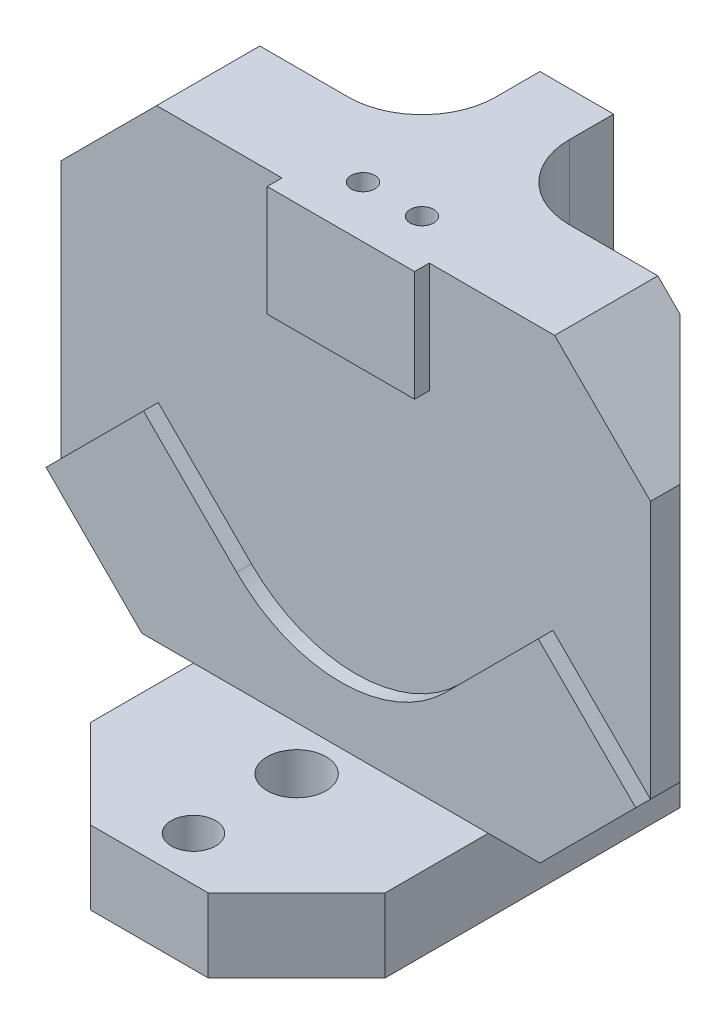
ISO-10303-21;
HEADER;
FILE_DESCRIPTION(('STEP AP214'),'2;1');
FILE_NAME('part.step','',(''),(''),'','','');
FILE_SCHEMA(('AUTOMOTIVE_DESIGN { 1 0 10303 214 1 1 1 1 }'));
ENDSEC;
DATA;
#1=APPLICATION_CONTEXT('core data for automotive mechanical design processes');
#2=APPLICATION_PROTOCOL_DEFINITION('international standard','automotive_design',2000,#1);
#3=PRODUCT_CONTEXT('',#1,'mechanical');
#4=PRODUCT('Part','Part','',(#3));
#5=PRODUCT_RELATED_PRODUCT_CATEGORY('part','',(#4));
#6=PRODUCT_DEFINITION_FORMATION('','',#4);
#7=PRODUCT_DEFINITION_CONTEXT('part definition',#1,'design');
#8=PRODUCT_DEFINITION('design','',#6,#7);
#9=PRODUCT_DEFINITION_SHAPE('','',#8);
#10=(LENGTH_UNIT() NAMED_UNIT(*) SI_UNIT(.MILLI.,.METRE.));
#11=(NAMED_UNIT(*) PLANE_ANGLE_UNIT() SI_UNIT($,.RADIAN.));
#12=(NAMED_UNIT(*) SI_UNIT($,.STERADIAN.) SOLID_ANGLE_UNIT());
#13=UNCERTAINTY_MEASURE_WITH_UNIT(LENGTH_MEASURE(1.E-05),#10,'distance_accuracy_value','');
#14=(GEOMETRIC_REPRESENTATION_CONTEXT(3) GLOBAL_UNCERTAINTY_ASSIGNED_CONTEXT((#13)) GLOBAL_UNIT_ASSIGNED_CONTEXT((#10,
#11,#12)) REPRESENTATION_CONTEXT('',''));
#15=CARTESIAN_POINT('',(0.,0.,0.));
#16=DIRECTION('',(0.,0.,1.));
#17=DIRECTION('',(1.,0.,0.));
#18=AXIS2_PLACEMENT_3D('',#15,#16,#17);
#19=CARTESIAN_POINT('',(0.,-15.,0.));
#20=DIRECTION('',(0.,-1.,0.));
#21=DIRECTION('',(1.,0.,0.));
#22=AXIS2_PLACEMENT_3D('',#19,#20,#21);
#23=PLANE('',#22);
#24=CARTESIAN_POINT('',(0.,-15.,-10.5));
#25=DIRECTION('',(0.,1.,0.));
#26=DIRECTION('',(-1.,0.,0.));
#27=AXIS2_PLACEMENT_3D('',#24,#25,#26);
#28=CIRCLE('',#27,0.85);
#29=CARTESIAN_POINT('',(-0.849999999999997,-15.,-10.5));
#30=VERTEX_POINT('',#29);
#31=EDGE_CURVE('E372',#30,#30,#28,.T.);
#32=ORIENTED_EDGE('',*,*,#31,.F.);
#33=EDGE_LOOP('',(#32));
#34=FACE_BOUND('',#33,.T.);
#35=CARTESIAN_POINT('',(6.5,-15.,-4.));
#36=DIRECTION('',(0.,1.,0.));
#37=DIRECTION('',(1.,0.,0.));
#38=AXIS2_PLACEMENT_3D('',#35,#36,#37);
#39=CIRCLE('',#38,1.5);
#40=CARTESIAN_POINT('',(8.,-15.,-4.));
#41=VERTEX_POINT('',#40);
#42=EDGE_CURVE('E379',#41,#41,#39,.T.);
#43=ORIENTED_EDGE('',*,*,#42,.F.);
#44=EDGE_LOOP('',(#43));
#45=FACE_BOUND('',#44,.T.);
#46=CARTESIAN_POINT('',(-6.5,-15.,-4.));
#47=DIRECTION('',(0.,1.,0.));
#48=DIRECTION('',(-1.,0.,0.));
#49=AXIS2_PLACEMENT_3D('',#46,#47,#48);
#50=CIRCLE('',#49,1.5);
#51=CARTESIAN_POINT('',(-8.,-15.,-4.));
#52=VERTEX_POINT('',#51);
#53=EDGE_CURVE('E373',#52,#52,#50,.T.);
#54=ORIENTED_EDGE('',*,*,#53,.F.);
#55=EDGE_LOOP('',(#54));
#56=FACE_BOUND('',#55,.T.);
#57=DIRECTION('',(1.,0.,0.));
#58=VECTOR('',#57,1.);
#59=CARTESIAN_POINT('',(-10.,-15.,-14.));
#60=LINE('',#59,#58);
#61=CARTESIAN_POINT('',(-0.999999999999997,-15.,-14.));
#62=VERTEX_POINT('',#61);
#63=CARTESIAN_POINT('',(0.999999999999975,-15.,-14.));
#64=VERTEX_POINT('',#63);
#65=EDGE_CURVE('E496',#62,#64,#60,.T.);
#66=ORIENTED_EDGE('',*,*,#65,.F.);
#67=DIRECTION('',(0.707106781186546,0.,-0.707106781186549));
#68=VECTOR('',#67,1.);
#69=CARTESIAN_POINT('',(-0.999999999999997,-15.,-14.));
#70=LINE('',#69,#68);
#71=CARTESIAN_POINT('',(-10.,-15.,-4.99999999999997));
#72=VERTEX_POINT('',#71);
#73=EDGE_CURVE('E593',#62,#72,#70,.F.);
#74=ORIENTED_EDGE('',*,*,#73,.T.);
#75=DIRECTION('',(0.,0.,-1.));
#76=VECTOR('',#75,1.);
#77=CARTESIAN_POINT('',(-10.,-15.,21.));
#78=LINE('',#77,#76);
#79=CARTESIAN_POINT('',(-10.,-15.,0.));
#80=VERTEX_POINT('',#79);
#81=EDGE_CURVE('E512',#80,#72,#78,.T.);
#82=ORIENTED_EDGE('',*,*,#81,.F.);
#83=DIRECTION('',(1.,0.,0.));
#84=VECTOR('',#83,1.);
#85=CARTESIAN_POINT('',(20.,-15.,0.));
#86=LINE('',#85,#84);
#87=CARTESIAN_POINT('',(-7.5,-15.,0.));
#88=VERTEX_POINT('',#87);
#89=EDGE_CURVE('E526',#80,#88,#86,.T.);
#90=ORIENTED_EDGE('',*,*,#89,.T.);
#91=CARTESIAN_POINT('',(-7.5,-15.,-5.));
#92=DIRECTION('',(0.,-1.,0.));
#93=DIRECTION('',(1.,0.,0.));
#94=AXIS2_PLACEMENT_3D('',#91,#92,#93);
#95=CIRCLE('',#94,5.);
#96=CARTESIAN_POINT('',(-2.5,-15.,-5.));
#97=VERTEX_POINT('',#96);
#98=EDGE_CURVE('E290',#88,#97,#95,.F.);
#99=ORIENTED_EDGE('',*,*,#98,.T.);
#100=DIRECTION('',(0.,0.,1.));
#101=VECTOR('',#100,1.);
#102=CARTESIAN_POINT('',(-2.5,-15.,-8.));
#103=LINE('',#102,#101);
#104=CARTESIAN_POINT('',(-2.5,-15.,-8.));
#105=VERTEX_POINT('',#104);
#106=EDGE_CURVE('E478',#105,#97,#103,.T.);
#107=ORIENTED_EDGE('',*,*,#106,.F.);
#108=DIRECTION('',(-1.,0.,0.));
#109=VECTOR('',#108,1.);
#110=CARTESIAN_POINT('',(2.5,-15.,-8.));
#111=LINE('',#110,#109);
#112=CARTESIAN_POINT('',(2.5,-15.,-8.));
#113=VERTEX_POINT('',#112);
#114=EDGE_CURVE('E483',#113,#105,#111,.T.);
#115=ORIENTED_EDGE('',*,*,#114,.F.);
#116=DIRECTION('',(0.,0.,-1.));
#117=VECTOR('',#116,1.);
#118=CARTESIAN_POINT('',(2.5,-15.,-8.));
#119=LINE('',#118,#117);
#120=CARTESIAN_POINT('',(2.5,-15.,-5.));
#121=VERTEX_POINT('',#120);
#122=EDGE_CURVE('E481',#121,#113,#119,.T.);
#123=ORIENTED_EDGE('',*,*,#122,.F.);
#124=CARTESIAN_POINT('',(7.5,-15.,-5.));
#125=DIRECTION('',(0.,-1.,0.));
#126=DIRECTION('',(1.,0.,0.));
#127=AXIS2_PLACEMENT_3D('',#124,#125,#126);
#128=CIRCLE('',#127,5.);
#129=CARTESIAN_POINT('',(7.5,-15.,0.));
#130=VERTEX_POINT('',#129);
#131=EDGE_CURVE('E568',#121,#130,#128,.F.);
#132=ORIENTED_EDGE('',*,*,#131,.T.);
#133=CARTESIAN_POINT('',(10.,-15.,0.));
#134=VERTEX_POINT('',#133);
#135=EDGE_CURVE('E527',#130,#134,#86,.T.);
#136=ORIENTED_EDGE('',*,*,#135,.T.);
#137=DIRECTION('',(0.,0.,1.));
#138=VECTOR('',#137,1.);
#139=CARTESIAN_POINT('',(10.,-15.,21.));
#140=LINE('',#139,#138);
#141=CARTESIAN_POINT('',(10.,-15.,-4.99999999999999));
#142=VERTEX_POINT('',#141);
#143=EDGE_CURVE('E506',#142,#134,#140,.T.);
#144=ORIENTED_EDGE('',*,*,#143,.F.);
#145=DIRECTION('',(0.707106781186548,0.,0.707106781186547));
#146=VECTOR('',#145,1.);
#147=CARTESIAN_POINT('',(10.,-15.,-4.99999999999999));
#148=LINE('',#147,#146);
#149=EDGE_CURVE('E591',#142,#64,#148,.F.);
#150=ORIENTED_EDGE('',*,*,#149,.T.);
#151=EDGE_LOOP('',(#66,#74,#82,#90,#99,#107,#115,#123,#132,#136,#144,#150));
#152=FACE_BOUND('',#151,.T.);
#153=ADVANCED_FACE('F40',(#34,#45,#56,#152),#23,.F.);
#154=CARTESIAN_POINT('',(-10.,-20.,-14.));
#155=DIRECTION('',(0.,0.,1.));
#156=DIRECTION('',(1.,0.,0.));
#157=AXIS2_PLACEMENT_3D('',#154,#155,#156);
#158=PLANE('',#157);
#159=DIRECTION('',(1.,0.,0.));
#160=VECTOR('',#159,1.);
#161=CARTESIAN_POINT('',(-10.,-20.,-14.));
#162=LINE('',#161,#160);
#163=CARTESIAN_POINT('',(-0.999999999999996,-20.,-14.));
#164=VERTEX_POINT('',#163);
#165=CARTESIAN_POINT('',(0.999999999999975,-20.,-14.));
#166=VERTEX_POINT('',#165);
#167=EDGE_CURVE('E502',#164,#166,#162,.T.);
#168=ORIENTED_EDGE('',*,*,#167,.F.);
#169=DIRECTION('',(0.,1.,0.));
#170=VECTOR('',#169,1.);
#171=CARTESIAN_POINT('',(-0.999999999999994,-20.,-14.));
#172=LINE('',#171,#170);
#173=EDGE_CURVE('E588',#164,#62,#172,.T.);
#174=ORIENTED_EDGE('',*,*,#173,.T.);
#175=ORIENTED_EDGE('',*,*,#65,.T.);
#176=DIRECTION('',(0.,-1.,0.));
#177=VECTOR('',#176,1.);
#178=CARTESIAN_POINT('',(0.999999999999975,-20.,-14.));
#179=LINE('',#178,#177);
#180=EDGE_CURVE('E586',#64,#166,#179,.T.);
#181=ORIENTED_EDGE('',*,*,#180,.T.);
#182=EDGE_LOOP('',(#168,#174,#175,#181));
#183=FACE_BOUND('',#182,.T.);
#184=ADVANCED_FACE('F713',(#183),#158,.F.);
#185=CARTESIAN_POINT('',(0.,-20.,0.));
#186=DIRECTION('',(0.,-1.,0.));
#187=DIRECTION('',(1.,0.,0.));
#188=AXIS2_PLACEMENT_3D('',#185,#186,#187);
#189=PLANE('',#188);
#190=CARTESIAN_POINT('',(0.,-20.,11.));
#191=DIRECTION('',(0.,-1.,0.));
#192=DIRECTION('',(1.,0.,0.));
#193=AXIS2_PLACEMENT_3D('',#190,#191,#192);
#194=CIRCLE('',#193,2.);
#195=CARTESIAN_POINT('',(2.,-20.,11.));
#196=VERTEX_POINT('',#195);
#197=EDGE_CURVE('E365',#196,#196,#194,.T.);
#198=ORIENTED_EDGE('',*,*,#197,.F.);
#199=EDGE_LOOP('',(#198));
#200=FACE_BOUND('',#199,.T.);
#201=CARTESIAN_POINT('',(-6.5,-20.,-4.));
#202=DIRECTION('',(0.,1.,0.));
#203=DIRECTION('',(-1.,0.,0.));
#204=AXIS2_PLACEMENT_3D('',#201,#202,#203);
#205=CIRCLE('',#204,1.5);
#206=CARTESIAN_POINT('',(-7.99999999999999,-20.,-4.));
#207=VERTEX_POINT('',#206);
#208=EDGE_CURVE('E369',#207,#207,#205,.T.);
#209=ORIENTED_EDGE('',*,*,#208,.T.);
#210=EDGE_LOOP('',(#209));
#211=FACE_BOUND('',#210,.T.);
#212=CARTESIAN_POINT('',(6.5,-20.,-4.));
#213=DIRECTION('',(0.,1.,0.));
#214=DIRECTION('',(1.,0.,0.));
#215=AXIS2_PLACEMENT_3D('',#212,#213,#214);
#216=CIRCLE('',#215,1.5);
#217=CARTESIAN_POINT('',(8.,-20.,-4.));
#218=VERTEX_POINT('',#217);
#219=EDGE_CURVE('E376',#218,#218,#216,.T.);
#220=ORIENTED_EDGE('',*,*,#219,.T.);
#221=EDGE_LOOP('',(#220));
#222=FACE_BOUND('',#221,.T.);
#223=CARTESIAN_POINT('',(0.,-20.,18.));
#224=DIRECTION('',(0.,1.,0.));
#225=DIRECTION('',(-1.,0.,0.));
#226=AXIS2_PLACEMENT_3D('',#223,#224,#225);
#227=CIRCLE('',#226,1.5);
#228=CARTESIAN_POINT('',(-1.5,-20.,18.));
#229=VERTEX_POINT('',#228);
#230=EDGE_CURVE('E382',#229,#229,#227,.T.);
#231=ORIENTED_EDGE('',*,*,#230,.T.);
#232=EDGE_LOOP('',(#231));
#233=FACE_BOUND('',#232,.T.);
#234=CARTESIAN_POINT('',(0.,-20.,-10.5));
#235=DIRECTION('',(0.,1.,0.));
#236=DIRECTION('',(-1.,0.,0.));
#237=AXIS2_PLACEMENT_3D('',#234,#235,#236);
#238=CIRCLE('',#237,0.85);
#239=CARTESIAN_POINT('',(-0.849999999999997,-20.,-10.5));
#240=VERTEX_POINT('',#239);
#241=EDGE_CURVE('E387',#240,#240,#238,.T.);
#242=ORIENTED_EDGE('',*,*,#241,.T.);
#243=EDGE_LOOP('',(#242));
#244=FACE_BOUND('',#243,.T.);
#245=DIRECTION('',(0.,0.,-1.));
#246=VECTOR('',#245,1.);
#247=CARTESIAN_POINT('',(-10.,-20.,21.));
#248=LINE('',#247,#246);
#249=CARTESIAN_POINT('',(-10.,-20.,15.));
#250=VERTEX_POINT('',#249);
#251=CARTESIAN_POINT('',(-10.,-20.,-4.99999999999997));
#252=VERTEX_POINT('',#251);
#253=EDGE_CURVE('E499',#250,#252,#248,.T.);
#254=ORIENTED_EDGE('',*,*,#253,.T.);
#255=DIRECTION('',(-0.707106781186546,0.,0.707106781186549));
#256=VECTOR('',#255,1.);
#257=CARTESIAN_POINT('',(-7.5,-20.,-7.49999999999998));
#258=LINE('',#257,#256);
#259=EDGE_CURVE('E599',#252,#164,#258,.F.);
#260=ORIENTED_EDGE('',*,*,#259,.T.);
#261=ORIENTED_EDGE('',*,*,#167,.T.);
#262=DIRECTION('',(-0.707106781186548,0.,-0.707106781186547));
#263=VECTOR('',#262,1.);
#264=CARTESIAN_POINT('',(7.49999999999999,-20.,-7.5));
#265=LINE('',#264,#263);
#266=CARTESIAN_POINT('',(10.,-20.,-4.99999999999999));
#267=VERTEX_POINT('',#266);
#268=EDGE_CURVE('E597',#166,#267,#265,.F.);
#269=ORIENTED_EDGE('',*,*,#268,.T.);
#270=DIRECTION('',(0.,0.,1.));
#271=VECTOR('',#270,1.);
#272=CARTESIAN_POINT('',(10.,-20.,21.));
#273=LINE('',#272,#271);
#274=CARTESIAN_POINT('',(10.,-20.,15.));
#275=VERTEX_POINT('',#274);
#276=EDGE_CURVE('E493',#267,#275,#273,.T.);
#277=ORIENTED_EDGE('',*,*,#276,.T.);
#278=DIRECTION('',(0.707106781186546,0.,-0.707106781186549));
#279=VECTOR('',#278,1.);
#280=CARTESIAN_POINT('',(12.5,-20.,12.5));
#281=LINE('',#280,#279);
#282=CARTESIAN_POINT('',(4.00000000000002,-20.,21.));
#283=VERTEX_POINT('',#282);
#284=EDGE_CURVE('E547',#275,#283,#281,.F.);
#285=ORIENTED_EDGE('',*,*,#284,.T.);
#286=DIRECTION('',(-1.,0.,0.));
#287=VECTOR('',#286,1.);
#288=CARTESIAN_POINT('',(-10.,-20.,21.));
#289=LINE('',#288,#287);
#290=CARTESIAN_POINT('',(-3.99999999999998,-20.,21.));
#291=VERTEX_POINT('',#290);
#292=EDGE_CURVE('E495',#283,#291,#289,.T.);
#293=ORIENTED_EDGE('',*,*,#292,.T.);
#294=DIRECTION('',(0.707106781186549,0.,0.707106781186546));
#295=VECTOR('',#294,1.);
#296=CARTESIAN_POINT('',(-12.5,-20.,12.5));
#297=LINE('',#296,#295);
#298=EDGE_CURVE('E549',#291,#250,#297,.F.);
#299=ORIENTED_EDGE('',*,*,#298,.T.);
#300=EDGE_LOOP('',(#254,#260,#261,#269,#277,#285,#293,#299));
#301=FACE_BOUND('',#300,.T.);
#302=ADVANCED_FACE('F710',(#200,#211,#222,#233,#244,#301),#189,.T.);
#303=CARTESIAN_POINT('',(-20.,-15.,7.));
#304=DIRECTION('',(1.,0.,0.));
#305=DIRECTION('',(0.,0.,-1.));
#306=AXIS2_PLACEMENT_3D('',#303,#304,#305);
#307=PLANE('',#306);
#308=DIRECTION('',(0.,-1.,0.));
#309=VECTOR('',#308,1.);
#310=CARTESIAN_POINT('',(-20.,-15.,7.));
#311=LINE('',#310,#309);
#312=CARTESIAN_POINT('',(-20.,8.99999999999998,7.));
#313=VERTEX_POINT('',#312);
#314=CARTESIAN_POINT('',(-20.,-8.49999999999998,7.));
#315=VERTEX_POINT('',#314);
#316=EDGE_CURVE('E518',#313,#315,#311,.T.);
#317=ORIENTED_EDGE('',*,*,#316,.F.);
#318=DIRECTION('',(0.,0.,-1.));
#319=VECTOR('',#318,1.);
#320=CARTESIAN_POINT('',(-20.,8.99999999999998,5.));
#321=LINE('',#320,#319);
#322=CARTESIAN_POINT('',(-20.,8.99999999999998,5.));
#323=VERTEX_POINT('',#322);
#324=EDGE_CURVE('E613',#313,#323,#321,.T.);
#325=ORIENTED_EDGE('',*,*,#324,.T.);
#326=DIRECTION('',(0.,-1.,0.));
#327=VECTOR('',#326,1.);
#328=CARTESIAN_POINT('',(-20.,-15.,5.));
#329=LINE('',#328,#327);
#330=CARTESIAN_POINT('',(-20.,-8.49999999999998,5.));
#331=VERTEX_POINT('',#330);
#332=EDGE_CURVE('E573',#323,#331,#329,.T.);
#333=ORIENTED_EDGE('',*,*,#332,.T.);
#334=DIRECTION('',(0.,0.,1.));
#335=VECTOR('',#334,1.);
#336=CARTESIAN_POINT('',(-20.,-8.49999999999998,7.));
#337=LINE('',#336,#335);
#338=EDGE_CURVE('E537',#331,#315,#337,.T.);
#339=ORIENTED_EDGE('',*,*,#338,.T.);
#340=EDGE_LOOP('',(#317,#325,#333,#339));
#341=FACE_BOUND('',#340,.T.);
#342=ADVANCED_FACE('F740',(#341),#307,.F.);
#343=CARTESIAN_POINT('',(-10.,-20.,21.));
#344=DIRECTION('',(1.,0.,0.));
#345=DIRECTION('',(0.,1.,0.));
#346=AXIS2_PLACEMENT_3D('',#343,#344,#345);
#347=PLANE('',#346);
#348=ORIENTED_EDGE('',*,*,#81,.T.);
#349=DIRECTION('',(0.,-1.,0.));
#350=VECTOR('',#349,1.);
#351=CARTESIAN_POINT('',(-10.,-20.,-4.99999999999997));
#352=LINE('',#351,#350);
#353=EDGE_CURVE('E595',#72,#252,#352,.T.);
#354=ORIENTED_EDGE('',*,*,#353,.T.);
#355=ORIENTED_EDGE('',*,*,#253,.F.);
#356=DIRECTION('',(0.,1.,0.));
#357=VECTOR('',#356,1.);
#358=CARTESIAN_POINT('',(-10.,-20.,15.));
#359=LINE('',#358,#357);
#360=CARTESIAN_POINT('',(-10.,-15.,15.));
#361=VERTEX_POINT('',#360);
#362=EDGE_CURVE('E544',#250,#361,#359,.T.);
#363=ORIENTED_EDGE('',*,*,#362,.T.);
#364=CARTESIAN_POINT('',(-10.,-15.,8.));
#365=VERTEX_POINT('',#364);
#366=EDGE_CURVE('E513',#361,#365,#78,.T.);
#367=ORIENTED_EDGE('',*,*,#366,.T.);
#368=EDGE_CURVE('E515',#365,#80,#78,.T.);
#369=ORIENTED_EDGE('',*,*,#368,.T.);
#370=EDGE_LOOP('',(#348,#354,#355,#363,#367,#369));
#371=FACE_BOUND('',#370,.T.);
#372=ADVANCED_FACE('F702',(#371),#347,.F.);
#373=CARTESIAN_POINT('',(10.,-20.,21.));
#374=DIRECTION('',(-1.,0.,0.));
#375=DIRECTION('',(0.,-1.,0.));
#376=AXIS2_PLACEMENT_3D('',#373,#374,#375);
#377=PLANE('',#376);
#378=ORIENTED_EDGE('',*,*,#276,.F.);
#379=DIRECTION('',(0.,1.,0.));
#380=VECTOR('',#379,1.);
#381=CARTESIAN_POINT('',(10.,-20.,-4.99999999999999));
#382=LINE('',#381,#380);
#383=EDGE_CURVE('E601',#267,#142,#382,.T.);
#384=ORIENTED_EDGE('',*,*,#383,.T.);
#385=ORIENTED_EDGE('',*,*,#143,.T.);
#386=CARTESIAN_POINT('',(9.99999999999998,-15.,8.));
#387=VERTEX_POINT('',#386);
#388=EDGE_CURVE('E509',#134,#387,#140,.T.);
#389=ORIENTED_EDGE('',*,*,#388,.T.);
#390=CARTESIAN_POINT('',(10.,-15.,15.));
#391=VERTEX_POINT('',#390);
#392=EDGE_CURVE('E492',#387,#391,#140,.T.);
#393=ORIENTED_EDGE('',*,*,#392,.T.);
#394=DIRECTION('',(0.,-1.,0.));
#395=VECTOR('',#394,1.);
#396=CARTESIAN_POINT('',(10.,-20.,15.));
#397=LINE('',#396,#395);
#398=EDGE_CURVE('E561',#391,#275,#397,.T.);
#399=ORIENTED_EDGE('',*,*,#398,.T.);
#400=EDGE_LOOP('',(#378,#384,#385,#389,#393,#399));
#401=FACE_BOUND('',#400,.T.);
#402=ADVANCED_FACE('F719',(#401),#377,.F.);
#403=CARTESIAN_POINT('',(0.,0.,7.));
#404=DIRECTION('',(0.,0.,1.));
#405=DIRECTION('',(1.,0.,0.));
#406=AXIS2_PLACEMENT_3D('',#403,#404,#405);
#407=PLANE('',#406);
#408=DIRECTION('',(1.,0.,0.));
#409=VECTOR('',#408,1.);
#410=CARTESIAN_POINT('',(-20.,15.5,7.));
#411=LINE('',#410,#409);
#412=CARTESIAN_POINT('',(-13.5,15.5,7.));
#413=VERTEX_POINT('',#412);
#414=CARTESIAN_POINT('',(-5.,15.5,7.));
#415=VERTEX_POINT('',#414);
#416=EDGE_CURVE('E306',#413,#415,#411,.T.);
#417=ORIENTED_EDGE('',*,*,#416,.F.);
#418=DIRECTION('',(-0.707106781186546,-0.707106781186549,0.));
#419=VECTOR('',#418,1.);
#420=CARTESIAN_POINT('',(-14.5,14.5,7.));
#421=LINE('',#420,#419);
#422=EDGE_CURVE('E611',#413,#313,#421,.T.);
#423=ORIENTED_EDGE('',*,*,#422,.T.);
#424=ORIENTED_EDGE('',*,*,#316,.T.);
#425=DIRECTION('',(0.707106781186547,0.707106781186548,0.));
#426=VECTOR('',#425,1.);
#427=CARTESIAN_POINT('',(-20.,-8.49999999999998,7.));
#428=LINE('',#427,#426);
#429=CARTESIAN_POINT('',(-13.3851053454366,-1.88510534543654,7.));
#430=VERTEX_POINT('',#429);
#431=EDGE_CURVE('E353',#315,#430,#428,.T.);
#432=ORIENTED_EDGE('',*,*,#431,.T.);
#433=DIRECTION('',(0.707106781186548,-0.707106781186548,0.));
#434=VECTOR('',#433,1.);
#435=CARTESIAN_POINT('',(-7.63510534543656,-7.63510534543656,7.));
#436=LINE('',#435,#434);
#437=CARTESIAN_POINT('',(-7.07106781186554,-8.19914287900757,7.));
#438=VERTEX_POINT('',#437);
#439=EDGE_CURVE('E470',#430,#438,#436,.T.);
#440=ORIENTED_EDGE('',*,*,#439,.T.);
#441=CARTESIAN_POINT('',(0.,-1.12807506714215,7.));
#442=DIRECTION('',(0.,0.,1.));
#443=DIRECTION('',(1.,0.,0.));
#444=AXIS2_PLACEMENT_3D('',#441,#442,#443);
#445=CIRCLE('',#444,10.);
#446=CARTESIAN_POINT('',(7.07106781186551,-8.19914287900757,7.));
#447=VERTEX_POINT('',#446);
#448=EDGE_CURVE('E455',#438,#447,#445,.T.);
#449=ORIENTED_EDGE('',*,*,#448,.T.);
#450=DIRECTION('',(-0.707106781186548,-0.707106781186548,0.));
#451=VECTOR('',#450,1.);
#452=CARTESIAN_POINT('',(7.63510534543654,-7.63510534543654,7.));
#453=LINE('',#452,#451);
#454=CARTESIAN_POINT('',(13.3851053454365,-1.88510534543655,7.));
#455=VERTEX_POINT('',#454);
#456=EDGE_CURVE('E460',#455,#447,#453,.T.);
#457=ORIENTED_EDGE('',*,*,#456,.F.);
#458=DIRECTION('',(0.707106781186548,-0.707106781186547,0.));
#459=VECTOR('',#458,1.);
#460=CARTESIAN_POINT('',(20.,-8.5,7.));
#461=LINE('',#460,#459);
#462=CARTESIAN_POINT('',(20.,-8.5,7.));
#463=VERTEX_POINT('',#462);
#464=EDGE_CURVE('E346',#455,#463,#461,.T.);
#465=ORIENTED_EDGE('',*,*,#464,.T.);
#466=DIRECTION('',(0.,1.,0.));
#467=VECTOR('',#466,1.);
#468=CARTESIAN_POINT('',(20.,-15.,7.));
#469=LINE('',#468,#467);
#470=CARTESIAN_POINT('',(20.,8.99999999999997,7.));
#471=VERTEX_POINT('',#470);
#472=EDGE_CURVE('E520',#463,#471,#469,.T.);
#473=ORIENTED_EDGE('',*,*,#472,.T.);
#474=DIRECTION('',(-0.707106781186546,0.707106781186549,0.));
#475=VECTOR('',#474,1.);
#476=CARTESIAN_POINT('',(14.5,14.5,7.));
#477=LINE('',#476,#475);
#478=CARTESIAN_POINT('',(13.5,15.5,7.));
#479=VERTEX_POINT('',#478);
#480=EDGE_CURVE('E609',#471,#479,#477,.T.);
#481=ORIENTED_EDGE('',*,*,#480,.T.);
#482=DIRECTION('',(1.,0.,0.));
#483=VECTOR('',#482,1.);
#484=CARTESIAN_POINT('',(5.,15.5,7.));
#485=LINE('',#484,#483);
#486=CARTESIAN_POINT('',(5.,15.5,7.));
#487=VERTEX_POINT('',#486);
#488=EDGE_CURVE('E331',#487,#479,#485,.T.);
#489=ORIENTED_EDGE('',*,*,#488,.F.);
#490=DIRECTION('',(0.,1.,0.));
#491=VECTOR('',#490,1.);
#492=CARTESIAN_POINT('',(5.,0.,7.));
#493=LINE('',#492,#491);
#494=CARTESIAN_POINT('',(5.,8.,7.));
#495=VERTEX_POINT('',#494);
#496=EDGE_CURVE('E446',#495,#487,#493,.T.);
#497=ORIENTED_EDGE('',*,*,#496,.F.);
#498=DIRECTION('',(1.,0.,0.));
#499=VECTOR('',#498,1.);
#500=CARTESIAN_POINT('',(0.,8.,7.));
#501=LINE('',#500,#499);
#502=CARTESIAN_POINT('',(-5.,8.,7.));
#503=VERTEX_POINT('',#502);
#504=EDGE_CURVE('E434',#503,#495,#501,.T.);
#505=ORIENTED_EDGE('',*,*,#504,.F.);
#506=DIRECTION('',(0.,1.,0.));
#507=VECTOR('',#506,1.);
#508=CARTESIAN_POINT('',(-5.,0.,7.));
#509=LINE('',#508,#507);
#510=EDGE_CURVE('E439',#503,#415,#509,.T.);
#511=ORIENTED_EDGE('',*,*,#510,.T.);
#512=EDGE_LOOP('',(#417,#423,#424,#432,#440,#449,#457,#465,#473,#481,#489,#497,#505,#511));
#513=FACE_BOUND('',#512,.T.);
#514=ADVANCED_FACE('F630',(#513),#407,.T.);
#515=CARTESIAN_POINT('',(0.,0.,0.));
#516=DIRECTION('',(0.,0.,1.));
#517=DIRECTION('',(1.,0.,0.));
#518=AXIS2_PLACEMENT_3D('',#515,#516,#517);
#519=PLANE('',#518);
#520=DIRECTION('',(-1.,0.,0.));
#521=VECTOR('',#520,1.);
#522=CARTESIAN_POINT('',(15.,15.5,0.));
#523=LINE('',#522,#521);
#524=CARTESIAN_POINT('',(13.5,15.5,0.));
#525=VERTEX_POINT('',#524);
#526=CARTESIAN_POINT('',(7.49999999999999,15.5,0.));
#527=VERTEX_POINT('',#526);
#528=EDGE_CURVE('E334',#525,#527,#523,.T.);
#529=ORIENTED_EDGE('',*,*,#528,.F.);
#530=DIRECTION('',(0.707106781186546,-0.707106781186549,0.));
#531=VECTOR('',#530,1.);
#532=CARTESIAN_POINT('',(13.5,15.5,0.));
#533=LINE('',#532,#531);
#534=CARTESIAN_POINT('',(15.,14.,0.));
#535=VERTEX_POINT('',#534);
#536=EDGE_CURVE('E62',#525,#535,#533,.T.);
#537=ORIENTED_EDGE('',*,*,#536,.T.);
#538=DIRECTION('',(0.,-1.,0.));
#539=VECTOR('',#538,1.);
#540=CARTESIAN_POINT('',(15.,0.,0.));
#541=LINE('',#540,#539);
#542=CARTESIAN_POINT('',(15.,-13.5,0.));
#543=VERTEX_POINT('',#542);
#544=EDGE_CURVE('E581',#535,#543,#541,.T.);
#545=ORIENTED_EDGE('',*,*,#544,.T.);
#546=DIRECTION('',(0.707106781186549,0.707106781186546,0.));
#547=VECTOR('',#546,1.);
#548=CARTESIAN_POINT('',(20.,-8.5,0.));
#549=LINE('',#548,#547);
#550=CARTESIAN_POINT('',(13.5,-15.,0.));
#551=VERTEX_POINT('',#550);
#552=EDGE_CURVE('E532',#543,#551,#549,.F.);
#553=ORIENTED_EDGE('',*,*,#552,.T.);
#554=EDGE_CURVE('E505',#134,#551,#86,.T.);
#555=ORIENTED_EDGE('',*,*,#554,.F.);
#556=ORIENTED_EDGE('',*,*,#135,.F.);
#557=DIRECTION('',(0.,-1.,0.));
#558=VECTOR('',#557,1.);
#559=CARTESIAN_POINT('',(7.49999999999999,15.,0.));
#560=LINE('',#559,#558);
#561=EDGE_CURVE('E295',#130,#527,#560,.F.);
#562=ORIENTED_EDGE('',*,*,#561,.T.);
#563=EDGE_LOOP('',(#529,#537,#545,#553,#555,#556,#562));
#564=FACE_BOUND('',#563,.T.);
#565=ADVANCED_FACE('F650',(#564),#519,.F.);
#566=DIRECTION('',(0.,1.,0.));
#567=VECTOR('',#566,1.);
#568=CARTESIAN_POINT('',(-15.,0.,0.));
#569=LINE('',#568,#567);
#570=CARTESIAN_POINT('',(-15.,-13.5,0.));
#571=VERTEX_POINT('',#570);
#572=CARTESIAN_POINT('',(-15.,14.,0.));
#573=VERTEX_POINT('',#572);
#574=EDGE_CURVE('E577',#571,#573,#569,.T.);
#575=ORIENTED_EDGE('',*,*,#574,.T.);
#576=DIRECTION('',(0.707106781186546,0.707106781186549,0.));
#577=VECTOR('',#576,1.);
#578=CARTESIAN_POINT('',(-13.5,15.5,0.));
#579=LINE('',#578,#577);
#580=CARTESIAN_POINT('',(-13.5,15.5,0.));
#581=VERTEX_POINT('',#580);
#582=EDGE_CURVE('E302',#573,#581,#579,.T.);
#583=ORIENTED_EDGE('',*,*,#582,.T.);
#584=DIRECTION('',(-1.,0.,0.));
#585=VECTOR('',#584,1.);
#586=CARTESIAN_POINT('',(-7.50000000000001,15.5,0.));
#587=LINE('',#586,#585);
#588=CARTESIAN_POINT('',(-7.50000000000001,15.5,0.));
#589=VERTEX_POINT('',#588);
#590=EDGE_CURVE('E298',#589,#581,#587,.T.);
#591=ORIENTED_EDGE('',*,*,#590,.F.);
#592=DIRECTION('',(0.,-1.,0.));
#593=VECTOR('',#592,1.);
#594=CARTESIAN_POINT('',(-7.5,-15.,0.));
#595=LINE('',#594,#593);
#596=EDGE_CURVE('E284',#589,#88,#595,.T.);
#597=ORIENTED_EDGE('',*,*,#596,.T.);
#598=ORIENTED_EDGE('',*,*,#89,.F.);
#599=CARTESIAN_POINT('',(-13.5,-15.,0.));
#600=VERTEX_POINT('',#599);
#601=EDGE_CURVE('E521',#600,#80,#86,.T.);
#602=ORIENTED_EDGE('',*,*,#601,.F.);
#603=DIRECTION('',(0.707106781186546,-0.707106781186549,0.));
#604=VECTOR('',#603,1.);
#605=CARTESIAN_POINT('',(-13.5,-15.,0.));
#606=LINE('',#605,#604);
#607=EDGE_CURVE('E534',#600,#571,#606,.F.);
#608=ORIENTED_EDGE('',*,*,#607,.T.);
#609=EDGE_LOOP('',(#575,#583,#591,#597,#598,#602,#608));
#610=FACE_BOUND('',#609,.T.);
#611=ADVANCED_FACE('F300',(#610),#519,.F.);
#612=CARTESIAN_POINT('',(20.,-15.,7.));
#613=DIRECTION('',(0.,1.,0.));
#614=DIRECTION('',(-1.,0.,0.));
#615=AXIS2_PLACEMENT_3D('',#612,#613,#614);
#616=PLANE('',#615);
#617=ORIENTED_EDGE('',*,*,#388,.F.);
#618=ORIENTED_EDGE('',*,*,#554,.T.);
#619=DIRECTION('',(0.,0.,1.));
#620=VECTOR('',#619,1.);
#621=CARTESIAN_POINT('',(13.5,-15.,7.));
#622=LINE('',#621,#620);
#623=CARTESIAN_POINT('',(13.5,-15.,8.));
#624=VERTEX_POINT('',#623);
#625=EDGE_CURVE('E524',#551,#624,#622,.T.);
#626=ORIENTED_EDGE('',*,*,#625,.T.);
#627=DIRECTION('',(-1.,0.,0.));
#628=VECTOR('',#627,1.);
#629=CARTESIAN_POINT('',(0.,-14.9999999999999,8.));
#630=LINE('',#629,#628);
#631=EDGE_CURVE('E398',#624,#387,#630,.T.);
#632=ORIENTED_EDGE('',*,*,#631,.T.);
#633=EDGE_LOOP('',(#617,#618,#626,#632));
#634=FACE_BOUND('',#633,.T.);
#635=ADVANCED_FACE('F677',(#634),#616,.F.);
#636=ORIENTED_EDGE('',*,*,#368,.F.);
#637=DIRECTION('',(-1.,0.,0.));
#638=VECTOR('',#637,1.);
#639=CARTESIAN_POINT('',(0.,-15.,8.));
#640=LINE('',#639,#638);
#641=CARTESIAN_POINT('',(-13.5,-15.,8.));
#642=VERTEX_POINT('',#641);
#643=EDGE_CURVE('E390',#365,#642,#640,.T.);
#644=ORIENTED_EDGE('',*,*,#643,.T.);
#645=DIRECTION('',(0.,0.,-1.));
#646=VECTOR('',#645,1.);
#647=CARTESIAN_POINT('',(-13.5,-15.,7.));
#648=LINE('',#647,#646);
#649=EDGE_CURVE('E529',#642,#600,#648,.T.);
#650=ORIENTED_EDGE('',*,*,#649,.T.);
#651=ORIENTED_EDGE('',*,*,#601,.T.);
#652=EDGE_LOOP('',(#636,#644,#650,#651));
#653=FACE_BOUND('',#652,.T.);
#654=ADVANCED_FACE('F734',(#653),#616,.F.);
#655=CARTESIAN_POINT('',(20.,-15.,7.));
#656=DIRECTION('',(-1.,0.,0.));
#657=DIRECTION('',(0.,0.,1.));
#658=AXIS2_PLACEMENT_3D('',#655,#656,#657);
#659=PLANE('',#658);
#660=DIRECTION('',(0.,1.,0.));
#661=VECTOR('',#660,1.);
#662=CARTESIAN_POINT('',(20.,-15.,5.));
#663=LINE('',#662,#661);
#664=CARTESIAN_POINT('',(20.,-8.5,5.));
#665=VERTEX_POINT('',#664);
#666=CARTESIAN_POINT('',(20.,8.99999999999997,5.));
#667=VERTEX_POINT('',#666);
#668=EDGE_CURVE('E579',#665,#667,#663,.T.);
#669=ORIENTED_EDGE('',*,*,#668,.T.);
#670=DIRECTION('',(0.,0.,1.));
#671=VECTOR('',#670,1.);
#672=CARTESIAN_POINT('',(20.,8.99999999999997,7.));
#673=LINE('',#672,#671);
#674=EDGE_CURVE('E11',#667,#471,#673,.T.);
#675=ORIENTED_EDGE('',*,*,#674,.T.);
#676=ORIENTED_EDGE('',*,*,#472,.F.);
#677=DIRECTION('',(0.,0.,-1.));
#678=VECTOR('',#677,1.);
#679=CARTESIAN_POINT('',(20.,-8.5,7.));
#680=LINE('',#679,#678);
#681=EDGE_CURVE('E540',#463,#665,#680,.T.);
#682=ORIENTED_EDGE('',*,*,#681,.T.);
#683=EDGE_LOOP('',(#669,#675,#676,#682));
#684=FACE_BOUND('',#683,.T.);
#685=ADVANCED_FACE('F1105',(#684),#659,.F.);
#686=CARTESIAN_POINT('',(-13.5,-15.,7.));
#687=DIRECTION('',(0.707106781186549,0.707106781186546,0.));
#688=DIRECTION('',(0.,0.,-1.));
#689=AXIS2_PLACEMENT_3D('',#686,#687,#688);
#690=PLANE('',#689);
#691=CARTESIAN_POINT('',(-14.9142135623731,-13.5857864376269,4.5));
#692=DIRECTION('',(-0.707106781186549,-0.707106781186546,0.));
#693=DIRECTION('',(0.707106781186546,-0.707106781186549,0.));
#694=AXIS2_PLACEMENT_3D('',#691,#692,#693);
#695=CIRCLE('',#694,0.79999999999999);
#696=CARTESIAN_POINT('',(-14.3485281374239,-14.1514718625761,4.5));
#697=VERTEX_POINT('',#696);
#698=EDGE_CURVE('E404',#697,#697,#695,.T.);
#699=ORIENTED_EDGE('',*,*,#698,.F.);
#700=EDGE_LOOP('',(#699));
#701=FACE_BOUND('',#700,.T.);
#702=CARTESIAN_POINT('',(-17.7426406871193,-10.7573593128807,4.5));
#703=DIRECTION('',(-0.707106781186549,-0.707106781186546,0.));
#704=DIRECTION('',(0.707106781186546,-0.707106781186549,0.));
#705=AXIS2_PLACEMENT_3D('',#702,#703,#704);
#706=CIRCLE('',#705,0.79999999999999);
#707=CARTESIAN_POINT('',(-17.1769552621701,-11.3230447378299,4.5));
#708=VERTEX_POINT('',#707);
#709=EDGE_CURVE('E410',#708,#708,#706,.T.);
#710=ORIENTED_EDGE('',*,*,#709,.F.);
#711=EDGE_LOOP('',(#710));
#712=FACE_BOUND('',#711,.T.);
#713=ORIENTED_EDGE('',*,*,#338,.F.);
#714=DIRECTION('',(0.577350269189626,-0.577350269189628,-0.577350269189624));
#715=VECTOR('',#714,1.);
#716=CARTESIAN_POINT('',(-16.3333333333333,-12.1666666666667,1.33333333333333));
#717=LINE('',#716,#715);
#718=EDGE_CURVE('E575',#331,#571,#717,.T.);
#719=ORIENTED_EDGE('',*,*,#718,.T.);
#720=ORIENTED_EDGE('',*,*,#607,.F.);
#721=ORIENTED_EDGE('',*,*,#649,.F.);
#722=DIRECTION('',(-0.707106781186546,0.707106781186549,0.));
#723=VECTOR('',#722,1.);
#724=CARTESIAN_POINT('',(-14.25,-14.25,8.));
#725=LINE('',#724,#723);
#726=CARTESIAN_POINT('',(-20.,-8.49999999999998,8.));
#727=VERTEX_POINT('',#726);
#728=EDGE_CURVE('E395',#642,#727,#725,.T.);
#729=ORIENTED_EDGE('',*,*,#728,.T.);
#730=DIRECTION('',(0.,0.,1.));
#731=VECTOR('',#730,1.);
#732=CARTESIAN_POINT('',(-20.,-8.49999999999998,7.));
#733=LINE('',#732,#731);
#734=EDGE_CURVE('E356',#315,#727,#733,.T.);
#735=ORIENTED_EDGE('',*,*,#734,.F.);
#736=EDGE_LOOP('',(#713,#719,#720,#721,#729,#735));
#737=FACE_BOUND('',#736,.T.);
#738=ADVANCED_FACE('F737',(#701,#712,#737),#690,.F.);
#739=CARTESIAN_POINT('',(20.,-8.5,7.));
#740=DIRECTION('',(-0.707106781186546,0.707106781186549,0.));
#741=DIRECTION('',(0.,0.,-1.));
#742=AXIS2_PLACEMENT_3D('',#739,#740,#741);
#743=PLANE('',#742);
#744=CARTESIAN_POINT('',(17.7426406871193,-10.7573593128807,4.5));
#745=DIRECTION('',(0.707106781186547,-0.707106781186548,0.));
#746=DIRECTION('',(0.707106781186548,0.707106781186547,0.));
#747=AXIS2_PLACEMENT_3D('',#744,#745,#746);
#748=CIRCLE('',#747,0.79999999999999);
#749=CARTESIAN_POINT('',(18.3083261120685,-10.1916738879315,4.5));
#750=VERTEX_POINT('',#749);
#751=EDGE_CURVE('E416',#750,#750,#748,.T.);
#752=ORIENTED_EDGE('',*,*,#751,.F.);
#753=EDGE_LOOP('',(#752));
#754=FACE_BOUND('',#753,.T.);
#755=CARTESIAN_POINT('',(14.9142135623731,-13.5857864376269,4.5));
#756=DIRECTION('',(0.707106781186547,-0.707106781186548,0.));
#757=DIRECTION('',(0.707106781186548,0.707106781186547,0.));
#758=AXIS2_PLACEMENT_3D('',#755,#756,#757);
#759=CIRCLE('',#758,0.79999999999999);
#760=CARTESIAN_POINT('',(15.4798989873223,-13.0201010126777,4.5));
#761=VERTEX_POINT('',#760);
#762=EDGE_CURVE('E422',#761,#761,#759,.T.);
#763=ORIENTED_EDGE('',*,*,#762,.F.);
#764=EDGE_LOOP('',(#763));
#765=FACE_BOUND('',#764,.T.);
#766=ORIENTED_EDGE('',*,*,#552,.F.);
#767=DIRECTION('',(0.577350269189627,0.577350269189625,0.577350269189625));
#768=VECTOR('',#767,1.);
#769=CARTESIAN_POINT('',(20.6666666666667,-7.83333333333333,5.66666666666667));
#770=LINE('',#769,#768);
#771=EDGE_CURVE('E583',#543,#665,#770,.T.);
#772=ORIENTED_EDGE('',*,*,#771,.T.);
#773=ORIENTED_EDGE('',*,*,#681,.F.);
#774=CARTESIAN_POINT('',(20.,-8.5,8.));
#775=VERTEX_POINT('',#774);
#776=EDGE_CURVE('E541',#775,#463,#680,.T.);
#777=ORIENTED_EDGE('',*,*,#776,.F.);
#778=DIRECTION('',(-0.707106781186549,-0.707106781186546,0.));
#779=VECTOR('',#778,1.);
#780=CARTESIAN_POINT('',(14.25,-14.25,8.));
#781=LINE('',#780,#779);
#782=EDGE_CURVE('E401',#775,#624,#781,.T.);
#783=ORIENTED_EDGE('',*,*,#782,.T.);
#784=ORIENTED_EDGE('',*,*,#625,.F.);
#785=EDGE_LOOP('',(#766,#772,#773,#777,#783,#784));
#786=FACE_BOUND('',#785,.T.);
#787=ADVANCED_FACE('F680',(#754,#765,#786),#743,.F.);
#788=CARTESIAN_POINT('',(-10.,-20.,21.));
#789=DIRECTION('',(0.,0.,-1.));
#790=DIRECTION('',(-1.,0.,0.));
#791=AXIS2_PLACEMENT_3D('',#788,#789,#790);
#792=PLANE('',#791);
#793=DIRECTION('',(-1.,0.,0.));
#794=VECTOR('',#793,1.);
#795=CARTESIAN_POINT('',(-10.,-15.,21.));
#796=LINE('',#795,#794);
#797=CARTESIAN_POINT('',(4.00000000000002,-15.,21.));
#798=VERTEX_POINT('',#797);
#799=CARTESIAN_POINT('',(-3.99999999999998,-15.,21.));
#800=VERTEX_POINT('',#799);
#801=EDGE_CURVE('E508',#798,#800,#796,.T.);
#802=ORIENTED_EDGE('',*,*,#801,.T.);
#803=DIRECTION('',(0.,-1.,0.));
#804=VECTOR('',#803,1.);
#805=CARTESIAN_POINT('',(-3.99999999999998,-20.,21.));
#806=LINE('',#805,#804);
#807=EDGE_CURVE('E559',#800,#291,#806,.T.);
#808=ORIENTED_EDGE('',*,*,#807,.T.);
#809=ORIENTED_EDGE('',*,*,#292,.F.);
#810=DIRECTION('',(0.,1.,0.));
#811=VECTOR('',#810,1.);
#812=CARTESIAN_POINT('',(4.00000000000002,-20.,21.));
#813=LINE('',#812,#811);
#814=EDGE_CURVE('E556',#283,#798,#813,.T.);
#815=ORIENTED_EDGE('',*,*,#814,.T.);
#816=EDGE_LOOP('',(#802,#808,#809,#815));
#817=FACE_BOUND('',#816,.T.);
#818=ADVANCED_FACE('F728',(#817),#792,.F.);
#819=CARTESIAN_POINT('',(0.,-15.,11.));
#820=DIRECTION('',(0.,1.,0.));
#821=DIRECTION('',(-1.,0.,0.));
#822=AXIS2_PLACEMENT_3D('',#819,#820,#821);
#823=CIRCLE('',#822,2.);
#824=CARTESIAN_POINT('',(-2.,-15.,11.));
#825=VERTEX_POINT('',#824);
#826=EDGE_CURVE('E361',#825,#825,#823,.T.);
#827=ORIENTED_EDGE('',*,*,#826,.F.);
#828=EDGE_LOOP('',(#827));
#829=FACE_BOUND('',#828,.T.);
#830=CARTESIAN_POINT('',(0.,-15.,18.));
#831=DIRECTION('',(0.,1.,0.));
#832=DIRECTION('',(-1.,0.,0.));
#833=AXIS2_PLACEMENT_3D('',#830,#831,#832);
#834=CIRCLE('',#833,1.5);
#835=CARTESIAN_POINT('',(-1.5,-15.,18.));
#836=VERTEX_POINT('',#835);
#837=EDGE_CURVE('E368',#836,#836,#834,.T.);
#838=ORIENTED_EDGE('',*,*,#837,.F.);
#839=EDGE_LOOP('',(#838));
#840=FACE_BOUND('',#839,.T.);
#841=ORIENTED_EDGE('',*,*,#392,.F.);
#842=DIRECTION('',(1.,0.,0.));
#843=VECTOR('',#842,1.);
#844=CARTESIAN_POINT('',(0.,-15.,8.));
#845=LINE('',#844,#843);
#846=EDGE_CURVE('E462',#365,#387,#845,.T.);
#847=ORIENTED_EDGE('',*,*,#846,.F.);
#848=ORIENTED_EDGE('',*,*,#366,.F.);
#849=DIRECTION('',(-0.707106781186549,0.,-0.707106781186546));
#850=VECTOR('',#849,1.);
#851=CARTESIAN_POINT('',(-10.,-15.,15.));
#852=LINE('',#851,#850);
#853=EDGE_CURVE('E554',#361,#800,#852,.F.);
#854=ORIENTED_EDGE('',*,*,#853,.T.);
#855=ORIENTED_EDGE('',*,*,#801,.F.);
#856=DIRECTION('',(-0.707106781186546,0.,0.707106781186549));
#857=VECTOR('',#856,1.);
#858=CARTESIAN_POINT('',(4.00000000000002,-15.,21.));
#859=LINE('',#858,#857);
#860=EDGE_CURVE('E551',#798,#391,#859,.F.);
#861=ORIENTED_EDGE('',*,*,#860,.T.);
#862=EDGE_LOOP('',(#841,#847,#848,#854,#855,#861));
#863=FACE_BOUND('',#862,.T.);
#864=ADVANCED_FACE('F695',(#829,#840,#863),#23,.F.);
#865=CARTESIAN_POINT('',(-10.,-20.,15.));
#866=DIRECTION('',(0.707106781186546,0.,-0.707106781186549));
#867=DIRECTION('',(0.,1.,0.));
#868=AXIS2_PLACEMENT_3D('',#865,#866,#867);
#869=PLANE('',#868);
#870=ORIENTED_EDGE('',*,*,#298,.F.);
#871=ORIENTED_EDGE('',*,*,#807,.F.);
#872=ORIENTED_EDGE('',*,*,#853,.F.);
#873=ORIENTED_EDGE('',*,*,#362,.F.);
#874=EDGE_LOOP('',(#870,#871,#872,#873));
#875=FACE_BOUND('',#874,.T.);
#876=ADVANCED_FACE('F731',(#875),#869,.F.);
#877=CARTESIAN_POINT('',(4.00000000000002,-20.,21.));
#878=DIRECTION('',(-0.707106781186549,0.,-0.707106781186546));
#879=DIRECTION('',(0.,1.,0.));
#880=AXIS2_PLACEMENT_3D('',#877,#878,#879);
#881=PLANE('',#880);
#882=ORIENTED_EDGE('',*,*,#284,.F.);
#883=ORIENTED_EDGE('',*,*,#398,.F.);
#884=ORIENTED_EDGE('',*,*,#860,.F.);
#885=ORIENTED_EDGE('',*,*,#814,.F.);
#886=EDGE_LOOP('',(#882,#883,#884,#885));
#887=FACE_BOUND('',#886,.T.);
#888=ADVANCED_FACE('F724',(#887),#881,.F.);
#889=CARTESIAN_POINT('',(2.49999999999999,24.4339811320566,-8.));
#890=DIRECTION('',(0.,0.,1.));
#891=DIRECTION('',(1.,0.,0.));
#892=AXIS2_PLACEMENT_3D('',#889,#890,#891);
#893=PLANE('',#892);
#894=DIRECTION('',(0.,-1.,0.));
#895=VECTOR('',#894,1.);
#896=CARTESIAN_POINT('',(-2.50000000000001,24.4339811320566,-8.));
#897=LINE('',#896,#895);
#898=CARTESIAN_POINT('',(-2.50000000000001,15.5,-8.));
#899=VERTEX_POINT('',#898);
#900=EDGE_CURVE('E486',#899,#105,#897,.T.);
#901=ORIENTED_EDGE('',*,*,#900,.F.);
#902=DIRECTION('',(-1.,0.,0.));
#903=VECTOR('',#902,1.);
#904=CARTESIAN_POINT('',(2.49999999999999,15.5,-8.));
#905=LINE('',#904,#903);
#906=CARTESIAN_POINT('',(2.49999999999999,15.5,-8.));
#907=VERTEX_POINT('',#906);
#908=EDGE_CURVE('E342',#907,#899,#905,.T.);
#909=ORIENTED_EDGE('',*,*,#908,.F.);
#910=DIRECTION('',(0.,-1.,0.));
#911=VECTOR('',#910,1.);
#912=CARTESIAN_POINT('',(2.49999999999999,24.4339811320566,-8.));
#913=LINE('',#912,#911);
#914=EDGE_CURVE('E489',#907,#113,#913,.T.);
#915=ORIENTED_EDGE('',*,*,#914,.T.);
#916=ORIENTED_EDGE('',*,*,#114,.T.);
#917=EDGE_LOOP('',(#901,#909,#915,#916));
#918=FACE_BOUND('',#917,.T.);
#919=ADVANCED_FACE('F665',(#918),#893,.F.);
#920=CARTESIAN_POINT('',(2.49999999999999,24.4339811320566,-8.));
#921=DIRECTION('',(-1.,0.,0.));
#922=DIRECTION('',(0.,-1.,0.));
#923=AXIS2_PLACEMENT_3D('',#920,#921,#922);
#924=PLANE('',#923);
#925=ORIENTED_EDGE('',*,*,#914,.F.);
#926=DIRECTION('',(0.,0.,-1.));
#927=VECTOR('',#926,1.);
#928=CARTESIAN_POINT('',(2.49999999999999,15.5,-5.));
#929=LINE('',#928,#927);
#930=CARTESIAN_POINT('',(2.49999999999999,15.5,-5.));
#931=VERTEX_POINT('',#930);
#932=EDGE_CURVE('E339',#931,#907,#929,.T.);
#933=ORIENTED_EDGE('',*,*,#932,.F.);
#934=DIRECTION('',(0.,-1.,0.));
#935=VECTOR('',#934,1.);
#936=CARTESIAN_POINT('',(2.5,-15.,-5.));
#937=LINE('',#936,#935);
#938=EDGE_CURVE('E564',#931,#121,#937,.T.);
#939=ORIENTED_EDGE('',*,*,#938,.T.);
#940=ORIENTED_EDGE('',*,*,#122,.T.);
#941=EDGE_LOOP('',(#925,#933,#939,#940));
#942=FACE_BOUND('',#941,.T.);
#943=ADVANCED_FACE('F661',(#942),#924,.F.);
#944=CARTESIAN_POINT('',(-2.50000000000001,24.4339811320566,-8.));
#945=DIRECTION('',(1.,0.,0.));
#946=DIRECTION('',(0.,1.,0.));
#947=AXIS2_PLACEMENT_3D('',#944,#945,#946);
#948=PLANE('',#947);
#949=ORIENTED_EDGE('',*,*,#106,.T.);
#950=DIRECTION('',(0.,-1.,0.));
#951=VECTOR('',#950,1.);
#952=CARTESIAN_POINT('',(-2.50000000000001,15.,-5.));
#953=LINE('',#952,#951);
#954=CARTESIAN_POINT('',(-2.50000000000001,15.5,-5.));
#955=VERTEX_POINT('',#954);
#956=EDGE_CURVE('E294',#97,#955,#953,.F.);
#957=ORIENTED_EDGE('',*,*,#956,.T.);
#958=DIRECTION('',(0.,0.,1.));
#959=VECTOR('',#958,1.);
#960=CARTESIAN_POINT('',(-2.50000000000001,15.5,-8.));
#961=LINE('',#960,#959);
#962=EDGE_CURVE('E313',#899,#955,#961,.T.);
#963=ORIENTED_EDGE('',*,*,#962,.F.);
#964=ORIENTED_EDGE('',*,*,#900,.T.);
#965=EDGE_LOOP('',(#949,#957,#963,#964));
#966=FACE_BOUND('',#965,.T.);
#967=ADVANCED_FACE('F667',(#966),#948,.F.);
#968=CARTESIAN_POINT('',(7.49999999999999,24.4339811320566,-5.));
#969=DIRECTION('',(0.,1.,0.));
#970=DIRECTION('',(-1.,0.,0.));
#971=AXIS2_PLACEMENT_3D('',#968,#969,#970);
#972=CYLINDRICAL_SURFACE('',#971,5.);
#973=ORIENTED_EDGE('',*,*,#938,.F.);
#974=CARTESIAN_POINT('',(7.49999999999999,15.5,-5.));
#975=DIRECTION('',(0.,-1.,0.));
#976=DIRECTION('',(-1.,0.,0.));
#977=AXIS2_PLACEMENT_3D('',#974,#975,#976);
#978=CIRCLE('',#977,5.);
#979=EDGE_CURVE('E336',#527,#931,#978,.T.);
#980=ORIENTED_EDGE('',*,*,#979,.F.);
#981=ORIENTED_EDGE('',*,*,#561,.F.);
#982=ORIENTED_EDGE('',*,*,#131,.F.);
#983=EDGE_LOOP('',(#973,#980,#981,#982));
#984=FACE_BOUND('',#983,.T.);
#985=ADVANCED_FACE('F657',(#984),#972,.F.);
#986=CARTESIAN_POINT('',(-7.50000000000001,0.,-5.));
#987=DIRECTION('',(0.,1.,0.));
#988=DIRECTION('',(-1.,0.,0.));
#989=AXIS2_PLACEMENT_3D('',#986,#987,#988);
#990=CYLINDRICAL_SURFACE('',#989,5.);
#991=ORIENTED_EDGE('',*,*,#596,.F.);
#992=CARTESIAN_POINT('',(-7.50000000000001,15.5,-5.));
#993=DIRECTION('',(0.,-1.,0.));
#994=DIRECTION('',(-1.,0.,0.));
#995=AXIS2_PLACEMENT_3D('',#992,#993,#994);
#996=CIRCLE('',#995,5.);
#997=EDGE_CURVE('E289',#955,#589,#996,.T.);
#998=ORIENTED_EDGE('',*,*,#997,.F.);
#999=ORIENTED_EDGE('',*,*,#956,.F.);
#1000=ORIENTED_EDGE('',*,*,#98,.F.);
#1001=EDGE_LOOP('',(#991,#998,#999,#1000));
#1002=FACE_BOUND('',#1001,.T.);
#1003=ADVANCED_FACE('F286',(#1002),#990,.F.);
#1004=CARTESIAN_POINT('',(0.,-1.12807506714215,8.));
#1005=DIRECTION('',(0.,0.,-1.));
#1006=DIRECTION('',(-1.,0.,0.));
#1007=AXIS2_PLACEMENT_3D('',#1004,#1005,#1006);
#1008=CYLINDRICAL_SURFACE('',#1007,10.);
#1009=ORIENTED_EDGE('',*,*,#448,.F.);
#1010=DIRECTION('',(0.,0.,-1.));
#1011=VECTOR('',#1010,1.);
#1012=CARTESIAN_POINT('',(-7.07106781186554,-8.19914287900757,8.));
#1013=LINE('',#1012,#1011);
#1014=CARTESIAN_POINT('',(-7.07106781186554,-8.19914287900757,8.));
#1015=VERTEX_POINT('',#1014);
#1016=EDGE_CURVE('E475',#1015,#438,#1013,.T.);
#1017=ORIENTED_EDGE('',*,*,#1016,.F.);
#1018=CARTESIAN_POINT('',(0.,-1.12807506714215,8.));
#1019=DIRECTION('',(0.,0.,1.));
#1020=DIRECTION('',(1.,0.,0.));
#1021=AXIS2_PLACEMENT_3D('',#1018,#1019,#1020);
#1022=CIRCLE('',#1021,10.);
#1023=CARTESIAN_POINT('',(7.07106781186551,-8.19914287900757,8.));
#1024=VERTEX_POINT('',#1023);
#1025=EDGE_CURVE('E456',#1015,#1024,#1022,.T.);
#1026=ORIENTED_EDGE('',*,*,#1025,.T.);
#1027=DIRECTION('',(0.,0.,-1.));
#1028=VECTOR('',#1027,1.);
#1029=CARTESIAN_POINT('',(7.07106781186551,-8.19914287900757,8.));
#1030=LINE('',#1029,#1028);
#1031=EDGE_CURVE('E467',#1024,#447,#1030,.T.);
#1032=ORIENTED_EDGE('',*,*,#1031,.T.);
#1033=EDGE_LOOP('',(#1009,#1017,#1026,#1032));
#1034=FACE_BOUND('',#1033,.T.);
#1035=ADVANCED_FACE('F755',(#1034),#1008,.F.);
#1036=CARTESIAN_POINT('',(-7.63510534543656,-7.63510534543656,8.));
#1037=DIRECTION('',(0.707106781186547,0.707106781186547,0.));
#1038=DIRECTION('',(-0.707106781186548,0.707106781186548,0.));
#1039=AXIS2_PLACEMENT_3D('',#1036,#1037,#1038);
#1040=PLANE('',#1039);
#1041=DIRECTION('',(0.,0.,1.));
#1042=VECTOR('',#1041,1.);
#1043=CARTESIAN_POINT('',(-13.3851053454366,-1.88510534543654,7.));
#1044=LINE('',#1043,#1042);
#1045=CARTESIAN_POINT('',(-13.3851053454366,-1.88510534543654,8.));
#1046=VERTEX_POINT('',#1045);
#1047=EDGE_CURVE('E358',#430,#1046,#1044,.T.);
#1048=ORIENTED_EDGE('',*,*,#1047,.T.);
#1049=DIRECTION('',(0.707106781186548,-0.707106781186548,0.));
#1050=VECTOR('',#1049,1.);
#1051=CARTESIAN_POINT('',(-7.63510534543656,-7.63510534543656,8.));
#1052=LINE('',#1051,#1050);
#1053=EDGE_CURVE('E459',#1046,#1015,#1052,.T.);
#1054=ORIENTED_EDGE('',*,*,#1053,.T.);
#1055=ORIENTED_EDGE('',*,*,#1016,.T.);
#1056=ORIENTED_EDGE('',*,*,#439,.F.);
#1057=EDGE_LOOP('',(#1048,#1054,#1055,#1056));
#1058=FACE_BOUND('',#1057,.T.);
#1059=ADVANCED_FACE('F748',(#1058),#1040,.T.);
#1060=CARTESIAN_POINT('',(7.63510534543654,-7.63510534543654,8.));
#1061=DIRECTION('',(0.707106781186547,-0.707106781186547,0.));
#1062=DIRECTION('',(0.707106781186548,0.707106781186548,0.));
#1063=AXIS2_PLACEMENT_3D('',#1060,#1061,#1062);
#1064=PLANE('',#1063);
#1065=DIRECTION('',(-0.707106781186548,-0.707106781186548,0.));
#1066=VECTOR('',#1065,1.);
#1067=CARTESIAN_POINT('',(7.63510534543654,-7.63510534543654,8.));
#1068=LINE('',#1067,#1066);
#1069=CARTESIAN_POINT('',(13.3851053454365,-1.88510534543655,8.));
#1070=VERTEX_POINT('',#1069);
#1071=EDGE_CURVE('E465',#1070,#1024,#1068,.T.);
#1072=ORIENTED_EDGE('',*,*,#1071,.F.);
#1073=DIRECTION('',(0.,0.,1.));
#1074=VECTOR('',#1073,1.);
#1075=CARTESIAN_POINT('',(13.3851053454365,-1.88510534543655,7.));
#1076=LINE('',#1075,#1074);
#1077=EDGE_CURVE('E349',#455,#1070,#1076,.T.);
#1078=ORIENTED_EDGE('',*,*,#1077,.F.);
#1079=ORIENTED_EDGE('',*,*,#456,.T.);
#1080=ORIENTED_EDGE('',*,*,#1031,.F.);
#1081=EDGE_LOOP('',(#1072,#1078,#1079,#1080));
#1082=FACE_BOUND('',#1081,.T.);
#1083=ADVANCED_FACE('F759',(#1082),#1064,.F.);
#1084=CARTESIAN_POINT('',(0.,0.,8.));
#1085=DIRECTION('',(0.,0.,1.));
#1086=DIRECTION('',(1.,0.,0.));
#1087=AXIS2_PLACEMENT_3D('',#1084,#1085,#1086);
#1088=PLANE('',#1087);
#1089=DIRECTION('',(0.707106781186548,-0.707106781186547,0.));
#1090=VECTOR('',#1089,1.);
#1091=CARTESIAN_POINT('',(20.,-8.5,8.));
#1092=LINE('',#1091,#1090);
#1093=EDGE_CURVE('E345',#1070,#775,#1092,.T.);
#1094=ORIENTED_EDGE('',*,*,#1093,.F.);
#1095=ORIENTED_EDGE('',*,*,#1071,.T.);
#1096=ORIENTED_EDGE('',*,*,#1025,.F.);
#1097=ORIENTED_EDGE('',*,*,#1053,.F.);
#1098=DIRECTION('',(0.707106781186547,0.707106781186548,0.));
#1099=VECTOR('',#1098,1.);
#1100=CARTESIAN_POINT('',(-20.,-8.49999999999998,8.));
#1101=LINE('',#1100,#1099);
#1102=EDGE_CURVE('E352',#727,#1046,#1101,.T.);
#1103=ORIENTED_EDGE('',*,*,#1102,.F.);
#1104=ORIENTED_EDGE('',*,*,#728,.F.);
#1105=ORIENTED_EDGE('',*,*,#643,.F.);
#1106=ORIENTED_EDGE('',*,*,#846,.T.);
#1107=ORIENTED_EDGE('',*,*,#631,.F.);
#1108=ORIENTED_EDGE('',*,*,#782,.F.);
#1109=EDGE_LOOP('',(#1094,#1095,#1096,#1097,#1103,#1104,#1105,#1106,#1107,#1108));
#1110=FACE_BOUND('',#1109,.T.);
#1111=ADVANCED_FACE('F688',(#1110),#1088,.T.);
#1112=CARTESIAN_POINT('',(0.,8.,8.));
#1113=DIRECTION('',(0.,1.,0.));
#1114=DIRECTION('',(0.,0.,1.));
#1115=AXIS2_PLACEMENT_3D('',#1112,#1113,#1114);
#1116=PLANE('',#1115);
#1117=ORIENTED_EDGE('',*,*,#504,.T.);
#1118=DIRECTION('',(0.,0.,-1.));
#1119=VECTOR('',#1118,1.);
#1120=CARTESIAN_POINT('',(5.,8.,8.));
#1121=LINE('',#1120,#1119);
#1122=CARTESIAN_POINT('',(5.,8.,8.));
#1123=VERTEX_POINT('',#1122);
#1124=EDGE_CURVE('E452',#1123,#495,#1121,.T.);
#1125=ORIENTED_EDGE('',*,*,#1124,.F.);
#1126=DIRECTION('',(1.,0.,0.));
#1127=VECTOR('',#1126,1.);
#1128=CARTESIAN_POINT('',(0.,8.,8.));
#1129=LINE('',#1128,#1127);
#1130=CARTESIAN_POINT('',(-5.,8.,8.));
#1131=VERTEX_POINT('',#1130);
#1132=EDGE_CURVE('E435',#1131,#1123,#1129,.T.);
#1133=ORIENTED_EDGE('',*,*,#1132,.F.);
#1134=DIRECTION('',(0.,0.,-1.));
#1135=VECTOR('',#1134,1.);
#1136=CARTESIAN_POINT('',(-5.,8.,8.));
#1137=LINE('',#1136,#1135);
#1138=EDGE_CURVE('E443',#1131,#503,#1137,.T.);
#1139=ORIENTED_EDGE('',*,*,#1138,.T.);
#1140=EDGE_LOOP('',(#1117,#1125,#1133,#1139));
#1141=FACE_BOUND('',#1140,.T.);
#1142=ADVANCED_FACE('F867',(#1141),#1116,.F.);
#1143=CARTESIAN_POINT('',(5.,0.,8.));
#1144=DIRECTION('',(-1.,0.,0.));
#1145=DIRECTION('',(0.,0.,1.));
#1146=AXIS2_PLACEMENT_3D('',#1143,#1144,#1145);
#1147=PLANE('',#1146);
#1148=ORIENTED_EDGE('',*,*,#496,.T.);
#1149=DIRECTION('',(0.,0.,-1.));
#1150=VECTOR('',#1149,1.);
#1151=CARTESIAN_POINT('',(5.,15.5,8.));
#1152=LINE('',#1151,#1150);
#1153=CARTESIAN_POINT('',(5.,15.5,8.));
#1154=VERTEX_POINT('',#1153);
#1155=EDGE_CURVE('E328',#1154,#487,#1152,.T.);
#1156=ORIENTED_EDGE('',*,*,#1155,.F.);
#1157=DIRECTION('',(0.,1.,0.));
#1158=VECTOR('',#1157,1.);
#1159=CARTESIAN_POINT('',(5.,0.,8.));
#1160=LINE('',#1159,#1158);
#1161=EDGE_CURVE('E438',#1123,#1154,#1160,.T.);
#1162=ORIENTED_EDGE('',*,*,#1161,.F.);
#1163=ORIENTED_EDGE('',*,*,#1124,.T.);
#1164=EDGE_LOOP('',(#1148,#1156,#1162,#1163));
#1165=FACE_BOUND('',#1164,.T.);
#1166=ADVANCED_FACE('F644',(#1165),#1147,.F.);
#1167=CARTESIAN_POINT('',(-5.,0.,8.));
#1168=DIRECTION('',(-1.,0.,0.));
#1169=DIRECTION('',(0.,0.,1.));
#1170=AXIS2_PLACEMENT_3D('',#1167,#1168,#1169);
#1171=PLANE('',#1170);
#1172=ORIENTED_EDGE('',*,*,#510,.F.);
#1173=ORIENTED_EDGE('',*,*,#1138,.F.);
#1174=DIRECTION('',(0.,1.,0.));
#1175=VECTOR('',#1174,1.);
#1176=CARTESIAN_POINT('',(-5.,0.,8.));
#1177=LINE('',#1176,#1175);
#1178=CARTESIAN_POINT('',(-5.,15.5,8.));
#1179=VERTEX_POINT('',#1178);
#1180=EDGE_CURVE('E441',#1131,#1179,#1177,.T.);
#1181=ORIENTED_EDGE('',*,*,#1180,.T.);
#1182=DIRECTION('',(0.,0.,1.));
#1183=VECTOR('',#1182,1.);
#1184=CARTESIAN_POINT('',(-5.,15.5,7.));
#1185=LINE('',#1184,#1183);
#1186=EDGE_CURVE('E322',#415,#1179,#1185,.T.);
#1187=ORIENTED_EDGE('',*,*,#1186,.F.);
#1188=EDGE_LOOP('',(#1172,#1173,#1181,#1187));
#1189=FACE_BOUND('',#1188,.T.);
#1190=ADVANCED_FACE('F635',(#1189),#1171,.T.);
#1191=CARTESIAN_POINT('',(0.,0.,8.));
#1192=DIRECTION('',(0.,0.,1.));
#1193=DIRECTION('',(1.,0.,0.));
#1194=AXIS2_PLACEMENT_3D('',#1191,#1192,#1193);
#1195=PLANE('',#1194);
#1196=ORIENTED_EDGE('',*,*,#1132,.T.);
#1197=ORIENTED_EDGE('',*,*,#1161,.T.);
#1198=DIRECTION('',(1.,0.,0.));
#1199=VECTOR('',#1198,1.);
#1200=CARTESIAN_POINT('',(-5.,15.5,8.));
#1201=LINE('',#1200,#1199);
#1202=EDGE_CURVE('E325',#1179,#1154,#1201,.T.);
#1203=ORIENTED_EDGE('',*,*,#1202,.F.);
#1204=ORIENTED_EDGE('',*,*,#1180,.F.);
#1205=EDGE_LOOP('',(#1196,#1197,#1203,#1204));
#1206=FACE_BOUND('',#1205,.T.);
#1207=ADVANCED_FACE('F640',(#1206),#1195,.T.);
#1208=CARTESIAN_POINT('',(-20.,-15.,5.));
#1209=DIRECTION('',(0.707106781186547,0.,0.707106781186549));
#1210=DIRECTION('',(0.,-1.,0.));
#1211=AXIS2_PLACEMENT_3D('',#1208,#1209,#1210);
#1212=PLANE('',#1211);
#1213=ORIENTED_EDGE('',*,*,#332,.F.);
#1214=DIRECTION('',(-0.577350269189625,-0.577350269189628,0.577350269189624));
#1215=VECTOR('',#1214,1.);
#1216=CARTESIAN_POINT('',(-28.,0.999999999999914,13.));
#1217=LINE('',#1216,#1215);
#1218=EDGE_CURVE('E615',#323,#573,#1217,.F.);
#1219=ORIENTED_EDGE('',*,*,#1218,.T.);
#1220=ORIENTED_EDGE('',*,*,#574,.F.);
#1221=ORIENTED_EDGE('',*,*,#718,.F.);
#1222=EDGE_LOOP('',(#1213,#1219,#1220,#1221));
#1223=FACE_BOUND('',#1222,.T.);
#1224=ADVANCED_FACE('F622',(#1223),#1212,.F.);
#1225=CARTESIAN_POINT('',(20.,-15.,5.));
#1226=DIRECTION('',(-0.707106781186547,0.,0.707106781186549));
#1227=DIRECTION('',(0.,1.,0.));
#1228=AXIS2_PLACEMENT_3D('',#1225,#1226,#1227);
#1229=PLANE('',#1228);
#1230=ORIENTED_EDGE('',*,*,#544,.F.);
#1231=DIRECTION('',(-0.577350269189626,0.577350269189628,-0.577350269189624));
#1232=VECTOR('',#1231,1.);
#1233=CARTESIAN_POINT('',(28.,0.999999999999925,13.));
#1234=LINE('',#1233,#1232);
#1235=EDGE_CURVE('E48',#535,#667,#1234,.F.);
#1236=ORIENTED_EDGE('',*,*,#1235,.T.);
#1237=ORIENTED_EDGE('',*,*,#668,.F.);
#1238=ORIENTED_EDGE('',*,*,#771,.F.);
#1239=EDGE_LOOP('',(#1230,#1236,#1237,#1238));
#1240=FACE_BOUND('',#1239,.T.);
#1241=ADVANCED_FACE('F843',(#1240),#1229,.F.);
#1242=CARTESIAN_POINT('',(10.6715728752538,-9.34314575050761,4.5));
#1243=DIRECTION('',(0.707106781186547,-0.707106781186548,0.));
#1244=DIRECTION('',(0.707106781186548,0.707106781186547,0.));
#1245=AXIS2_PLACEMENT_3D('',#1242,#1243,#1244);
#1246=CONICAL_SURFACE('',#1245,0.799999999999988,1.02974425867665);
#1247=CARTESIAN_POINT('',(10.3316747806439,-9.00324765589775,4.5));
#1248=VERTEX_POINT('',#1247);
#1249=VERTEX_LOOP('',#1248);
#1250=FACE_BOUND('',#1249,.T.);
#1251=CARTESIAN_POINT('',(10.6715728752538,-9.34314575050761,4.5));
#1252=DIRECTION('',(0.707106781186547,-0.707106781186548,0.));
#1253=DIRECTION('',(0.707106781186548,0.707106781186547,0.));
#1254=AXIS2_PLACEMENT_3D('',#1251,#1252,#1253);
#1255=CIRCLE('',#1254,0.799999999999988);
#1256=CARTESIAN_POINT('',(11.237258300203,-8.77746032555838,4.5));
#1257=VERTEX_POINT('',#1256);
#1258=EDGE_CURVE('E425',#1257,#1257,#1255,.T.);
#1259=ORIENTED_EDGE('',*,*,#1258,.T.);
#1260=EDGE_LOOP('',(#1259));
#1261=FACE_BOUND('',#1260,.T.);
#1262=ADVANCED_FACE('F839',(#1250,#1261),#1246,.F.);
#1263=CARTESIAN_POINT('',(14.9142135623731,-13.5857864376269,4.5));
#1264=DIRECTION('',(0.707106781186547,-0.707106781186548,0.));
#1265=DIRECTION('',(0.707106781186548,0.707106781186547,0.));
#1266=AXIS2_PLACEMENT_3D('',#1263,#1264,#1265);
#1267=CYLINDRICAL_SURFACE('',#1266,0.799999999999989);
#1268=ORIENTED_EDGE('',*,*,#1258,.F.);
#1269=EDGE_LOOP('',(#1268));
#1270=FACE_BOUND('',#1269,.T.);
#1271=ORIENTED_EDGE('',*,*,#762,.T.);
#1272=EDGE_LOOP('',(#1271));
#1273=FACE_BOUND('',#1272,.T.);
#1274=ADVANCED_FACE('F835',(#1270,#1273),#1267,.F.);
#1275=CARTESIAN_POINT('',(13.5,-6.51471862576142,4.5));
#1276=DIRECTION('',(0.707106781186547,-0.707106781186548,0.));
#1277=DIRECTION('',(0.707106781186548,0.707106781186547,0.));
#1278=AXIS2_PLACEMENT_3D('',#1275,#1276,#1277);
#1279=CONICAL_SURFACE('',#1278,0.799999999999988,1.02974425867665);
#1280=CARTESIAN_POINT('',(13.1601019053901,-6.17482053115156,4.5));
#1281=VERTEX_POINT('',#1280);
#1282=VERTEX_LOOP('',#1281);
#1283=FACE_BOUND('',#1282,.T.);
#1284=CARTESIAN_POINT('',(13.5,-6.51471862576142,4.5));
#1285=DIRECTION('',(0.707106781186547,-0.707106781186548,0.));
#1286=DIRECTION('',(0.707106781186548,0.707106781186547,0.));
#1287=AXIS2_PLACEMENT_3D('',#1284,#1285,#1286);
#1288=CIRCLE('',#1287,0.799999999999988);
#1289=CARTESIAN_POINT('',(14.0656854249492,-5.94903320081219,4.5));
#1290=VERTEX_POINT('',#1289);
#1291=EDGE_CURVE('E419',#1290,#1290,#1288,.T.);
#1292=ORIENTED_EDGE('',*,*,#1291,.T.);
#1293=EDGE_LOOP('',(#1292));
#1294=FACE_BOUND('',#1293,.T.);
#1295=ADVANCED_FACE('F831',(#1283,#1294),#1279,.F.);
#1296=CARTESIAN_POINT('',(17.7426406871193,-10.7573593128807,4.5));
#1297=DIRECTION('',(0.707106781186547,-0.707106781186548,0.));
#1298=DIRECTION('',(0.707106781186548,0.707106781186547,0.));
#1299=AXIS2_PLACEMENT_3D('',#1296,#1297,#1298);
#1300=CYLINDRICAL_SURFACE('',#1299,0.799999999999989);
#1301=ORIENTED_EDGE('',*,*,#1291,.F.);
#1302=EDGE_LOOP('',(#1301));
#1303=FACE_BOUND('',#1302,.T.);
#1304=ORIENTED_EDGE('',*,*,#751,.T.);
#1305=EDGE_LOOP('',(#1304));
#1306=FACE_BOUND('',#1305,.T.);
#1307=ADVANCED_FACE('F827',(#1303,#1306),#1300,.F.);
#1308=CARTESIAN_POINT('',(-13.5,-6.51471862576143,4.5));
#1309=DIRECTION('',(-0.707106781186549,-0.707106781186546,0.));
#1310=DIRECTION('',(0.707106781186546,-0.707106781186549,0.));
#1311=AXIS2_PLACEMENT_3D('',#1308,#1309,#1310);
#1312=CONICAL_SURFACE('',#1311,0.799999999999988,1.02974425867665);
#1313=CARTESIAN_POINT('',(-13.1601019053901,-6.17482053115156,4.5));
#1314=VERTEX_POINT('',#1313);
#1315=VERTEX_LOOP('',#1314);
#1316=FACE_BOUND('',#1315,.T.);
#1317=CARTESIAN_POINT('',(-13.5,-6.51471862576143,4.5));
#1318=DIRECTION('',(-0.707106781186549,-0.707106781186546,0.));
#1319=DIRECTION('',(0.707106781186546,-0.707106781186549,0.));
#1320=AXIS2_PLACEMENT_3D('',#1317,#1318,#1319);
#1321=CIRCLE('',#1320,0.799999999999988);
#1322=CARTESIAN_POINT('',(-12.9343145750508,-7.08040405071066,4.5));
#1323=VERTEX_POINT('',#1322);
#1324=EDGE_CURVE('E413',#1323,#1323,#1321,.T.);
#1325=ORIENTED_EDGE('',*,*,#1324,.T.);
#1326=EDGE_LOOP('',(#1325));
#1327=FACE_BOUND('',#1326,.T.);
#1328=ADVANCED_FACE('F823',(#1316,#1327),#1312,.F.);
#1329=CARTESIAN_POINT('',(-17.7426406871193,-10.7573593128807,4.5));
#1330=DIRECTION('',(-0.707106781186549,-0.707106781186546,0.));
#1331=DIRECTION('',(0.707106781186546,-0.707106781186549,0.));
#1332=AXIS2_PLACEMENT_3D('',#1329,#1330,#1331);
#1333=CYLINDRICAL_SURFACE('',#1332,0.799999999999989);
#1334=ORIENTED_EDGE('',*,*,#1324,.F.);
#1335=EDGE_LOOP('',(#1334));
#1336=FACE_BOUND('',#1335,.T.);
#1337=ORIENTED_EDGE('',*,*,#709,.T.);
#1338=EDGE_LOOP('',(#1337));
#1339=FACE_BOUND('',#1338,.T.);
#1340=ADVANCED_FACE('F819',(#1336,#1339),#1333,.F.);
#1341=CARTESIAN_POINT('',(-10.6715728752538,-9.34314575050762,4.5));
#1342=DIRECTION('',(-0.707106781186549,-0.707106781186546,0.));
#1343=DIRECTION('',(0.707106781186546,-0.707106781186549,0.));
#1344=AXIS2_PLACEMENT_3D('',#1341,#1342,#1343);
#1345=CONICAL_SURFACE('',#1344,0.799999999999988,1.02974425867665);
#1346=CARTESIAN_POINT('',(-10.3316747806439,-9.00324765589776,4.5));
#1347=VERTEX_POINT('',#1346);
#1348=VERTEX_LOOP('',#1347);
#1349=FACE_BOUND('',#1348,.T.);
#1350=CARTESIAN_POINT('',(-10.6715728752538,-9.34314575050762,4.5));
#1351=DIRECTION('',(-0.707106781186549,-0.707106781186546,0.));
#1352=DIRECTION('',(0.707106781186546,-0.707106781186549,0.));
#1353=AXIS2_PLACEMENT_3D('',#1350,#1351,#1352);
#1354=CIRCLE('',#1353,0.799999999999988);
#1355=CARTESIAN_POINT('',(-10.1058874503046,-9.90883117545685,4.5));
#1356=VERTEX_POINT('',#1355);
#1357=EDGE_CURVE('E407',#1356,#1356,#1354,.T.);
#1358=ORIENTED_EDGE('',*,*,#1357,.T.);
#1359=EDGE_LOOP('',(#1358));
#1360=FACE_BOUND('',#1359,.T.);
#1361=ADVANCED_FACE('F815',(#1349,#1360),#1345,.F.);
#1362=CARTESIAN_POINT('',(-14.9142135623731,-13.5857864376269,4.5));
#1363=DIRECTION('',(-0.707106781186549,-0.707106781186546,0.));
#1364=DIRECTION('',(0.707106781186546,-0.707106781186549,0.));
#1365=AXIS2_PLACEMENT_3D('',#1362,#1363,#1364);
#1366=CYLINDRICAL_SURFACE('',#1365,0.799999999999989);
#1367=ORIENTED_EDGE('',*,*,#1357,.F.);
#1368=EDGE_LOOP('',(#1367));
#1369=FACE_BOUND('',#1368,.T.);
#1370=ORIENTED_EDGE('',*,*,#698,.T.);
#1371=EDGE_LOOP('',(#1370));
#1372=FACE_BOUND('',#1371,.T.);
#1373=ADVANCED_FACE('F807',(#1369,#1372),#1366,.F.);
#1374=CARTESIAN_POINT('',(0.,-20.,-10.5));
#1375=DIRECTION('',(0.,1.,0.));
#1376=DIRECTION('',(-1.,0.,0.));
#1377=AXIS2_PLACEMENT_3D('',#1374,#1375,#1376);
#1378=CYLINDRICAL_SURFACE('',#1377,0.85);
#1379=ORIENTED_EDGE('',*,*,#241,.F.);
#1380=EDGE_LOOP('',(#1379));
#1381=FACE_BOUND('',#1380,.T.);
#1382=ORIENTED_EDGE('',*,*,#31,.T.);
#1383=EDGE_LOOP('',(#1382));
#1384=FACE_BOUND('',#1383,.T.);
#1385=ADVANCED_FACE('F797',(#1381,#1384),#1378,.F.);
#1386=CARTESIAN_POINT('',(0.,-20.,18.));
#1387=DIRECTION('',(0.,1.,0.));
#1388=DIRECTION('',(-1.,0.,0.));
#1389=AXIS2_PLACEMENT_3D('',#1386,#1387,#1388);
#1390=CYLINDRICAL_SURFACE('',#1389,1.5);
#1391=ORIENTED_EDGE('',*,*,#230,.F.);
#1392=EDGE_LOOP('',(#1391));
#1393=FACE_BOUND('',#1392,.T.);
#1394=ORIENTED_EDGE('',*,*,#837,.T.);
#1395=EDGE_LOOP('',(#1394));
#1396=FACE_BOUND('',#1395,.T.);
#1397=ADVANCED_FACE('F794',(#1393,#1396),#1390,.F.);
#1398=CARTESIAN_POINT('',(6.5,-20.,-4.));
#1399=DIRECTION('',(0.,1.,0.));
#1400=DIRECTION('',(-1.,0.,0.));
#1401=AXIS2_PLACEMENT_3D('',#1398,#1399,#1400);
#1402=CYLINDRICAL_SURFACE('',#1401,1.5);
#1403=ORIENTED_EDGE('',*,*,#219,.F.);
#1404=EDGE_LOOP('',(#1403));
#1405=FACE_BOUND('',#1404,.T.);
#1406=ORIENTED_EDGE('',*,*,#42,.T.);
#1407=EDGE_LOOP('',(#1406));
#1408=FACE_BOUND('',#1407,.T.);
#1409=ADVANCED_FACE('F796',(#1405,#1408),#1402,.F.);
#1410=CARTESIAN_POINT('',(-6.5,-20.,-4.));
#1411=DIRECTION('',(0.,1.,0.));
#1412=DIRECTION('',(-1.,0.,0.));
#1413=AXIS2_PLACEMENT_3D('',#1410,#1411,#1412);
#1414=CYLINDRICAL_SURFACE('',#1413,1.5);
#1415=ORIENTED_EDGE('',*,*,#208,.F.);
#1416=EDGE_LOOP('',(#1415));
#1417=FACE_BOUND('',#1416,.T.);
#1418=ORIENTED_EDGE('',*,*,#53,.T.);
#1419=EDGE_LOOP('',(#1418));
#1420=FACE_BOUND('',#1419,.T.);
#1421=ADVANCED_FACE('F804',(#1417,#1420),#1414,.F.);
#1422=CARTESIAN_POINT('',(0.,-25.,11.));
#1423=DIRECTION('',(0.,1.,0.));
#1424=DIRECTION('',(-1.,0.,0.));
#1425=AXIS2_PLACEMENT_3D('',#1422,#1423,#1424);
#1426=CYLINDRICAL_SURFACE('',#1425,2.);
#1427=ORIENTED_EDGE('',*,*,#197,.T.);
#1428=EDGE_LOOP('',(#1427));
#1429=FACE_BOUND('',#1428,.T.);
#1430=ORIENTED_EDGE('',*,*,#826,.T.);
#1431=EDGE_LOOP('',(#1430));
#1432=FACE_BOUND('',#1431,.T.);
#1433=ADVANCED_FACE('F769',(#1429,#1432),#1426,.F.);
#1434=CARTESIAN_POINT('',(-20.,-8.49999999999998,7.));
#1435=DIRECTION('',(0.707106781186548,-0.707106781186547,0.));
#1436=DIRECTION('',(0.707106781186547,0.707106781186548,0.));
#1437=AXIS2_PLACEMENT_3D('',#1434,#1435,#1436);
#1438=PLANE('',#1437);
#1439=ORIENTED_EDGE('',*,*,#1102,.T.);
#1440=ORIENTED_EDGE('',*,*,#1047,.F.);
#1441=ORIENTED_EDGE('',*,*,#431,.F.);
#1442=ORIENTED_EDGE('',*,*,#734,.T.);
#1443=EDGE_LOOP('',(#1439,#1440,#1441,#1442));
#1444=FACE_BOUND('',#1443,.T.);
#1445=ADVANCED_FACE('F744',(#1444),#1438,.F.);
#1446=CARTESIAN_POINT('',(20.,-8.5,7.));
#1447=DIRECTION('',(-0.707106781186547,-0.707106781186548,0.));
#1448=DIRECTION('',(0.707106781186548,-0.707106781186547,0.));
#1449=AXIS2_PLACEMENT_3D('',#1446,#1447,#1448);
#1450=PLANE('',#1449);
#1451=ORIENTED_EDGE('',*,*,#1093,.T.);
#1452=ORIENTED_EDGE('',*,*,#776,.T.);
#1453=ORIENTED_EDGE('',*,*,#464,.F.);
#1454=ORIENTED_EDGE('',*,*,#1077,.T.);
#1455=EDGE_LOOP('',(#1451,#1452,#1453,#1454));
#1456=FACE_BOUND('',#1455,.T.);
#1457=ADVANCED_FACE('F761',(#1456),#1450,.F.);
#1458=CARTESIAN_POINT('',(-0.999999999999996,-20.,-14.));
#1459=DIRECTION('',(0.707106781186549,0.,0.707106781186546));
#1460=DIRECTION('',(0.,1.,0.));
#1461=AXIS2_PLACEMENT_3D('',#1458,#1459,#1460);
#1462=PLANE('',#1461);
#1463=ORIENTED_EDGE('',*,*,#259,.F.);
#1464=ORIENTED_EDGE('',*,*,#353,.F.);
#1465=ORIENTED_EDGE('',*,*,#73,.F.);
#1466=ORIENTED_EDGE('',*,*,#173,.F.);
#1467=EDGE_LOOP('',(#1463,#1464,#1465,#1466));
#1468=FACE_BOUND('',#1467,.T.);
#1469=ADVANCED_FACE('F706',(#1468),#1462,.F.);
#1470=CARTESIAN_POINT('',(10.,-20.,-4.99999999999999));
#1471=DIRECTION('',(-0.707106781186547,0.,0.707106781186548));
#1472=DIRECTION('',(0.,1.,0.));
#1473=AXIS2_PLACEMENT_3D('',#1470,#1471,#1472);
#1474=PLANE('',#1473);
#1475=ORIENTED_EDGE('',*,*,#268,.F.);
#1476=ORIENTED_EDGE('',*,*,#180,.F.);
#1477=ORIENTED_EDGE('',*,*,#149,.F.);
#1478=ORIENTED_EDGE('',*,*,#383,.F.);
#1479=EDGE_LOOP('',(#1475,#1476,#1477,#1478));
#1480=FACE_BOUND('',#1479,.T.);
#1481=ADVANCED_FACE('F716',(#1480),#1474,.F.);
#1482=CARTESIAN_POINT('',(-7.50000000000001,15.5,-5.));
#1483=DIRECTION('',(0.,1.,0.));
#1484=DIRECTION('',(-1.,0.,0.));
#1485=AXIS2_PLACEMENT_3D('',#1482,#1483,#1484);
#1486=PLANE('',#1485);
#1487=CARTESIAN_POINT('',(-2.,15.5,4.5));
#1488=DIRECTION('',(0.,1.,0.));
#1489=DIRECTION('',(-1.,0.,0.));
#1490=AXIS2_PLACEMENT_3D('',#1487,#1488,#1489);
#1491=CIRCLE('',#1490,0.79999999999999);
#1492=CARTESIAN_POINT('',(-2.79999999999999,15.5,4.5));
#1493=VERTEX_POINT('',#1492);
#1494=EDGE_CURVE('E314',#1493,#1493,#1491,.T.);
#1495=ORIENTED_EDGE('',*,*,#1494,.F.);
#1496=EDGE_LOOP('',(#1495));
#1497=FACE_BOUND('',#1496,.T.);
#1498=ORIENTED_EDGE('',*,*,#590,.T.);
#1499=DIRECTION('',(0.,0.,1.));
#1500=VECTOR('',#1499,1.);
#1501=CARTESIAN_POINT('',(-13.5,15.5,7.));
#1502=LINE('',#1501,#1500);
#1503=EDGE_CURVE('E607',#581,#413,#1502,.T.);
#1504=ORIENTED_EDGE('',*,*,#1503,.T.);
#1505=ORIENTED_EDGE('',*,*,#416,.T.);
#1506=ORIENTED_EDGE('',*,*,#1186,.T.);
#1507=ORIENTED_EDGE('',*,*,#1202,.T.);
#1508=ORIENTED_EDGE('',*,*,#1155,.T.);
#1509=ORIENTED_EDGE('',*,*,#488,.T.);
#1510=DIRECTION('',(0.,0.,-1.));
#1511=VECTOR('',#1510,1.);
#1512=CARTESIAN_POINT('',(13.5,15.5,5.));
#1513=LINE('',#1512,#1511);
#1514=EDGE_CURVE('E604',#479,#525,#1513,.T.);
#1515=ORIENTED_EDGE('',*,*,#1514,.T.);
#1516=ORIENTED_EDGE('',*,*,#528,.T.);
#1517=ORIENTED_EDGE('',*,*,#979,.T.);
#1518=ORIENTED_EDGE('',*,*,#932,.T.);
#1519=ORIENTED_EDGE('',*,*,#908,.T.);
#1520=ORIENTED_EDGE('',*,*,#962,.T.);
#1521=ORIENTED_EDGE('',*,*,#997,.T.);
#1522=EDGE_LOOP('',(#1498,#1504,#1505,#1506,#1507,#1508,#1509,#1515,#1516,#1517,#1518,#1519,
#1520,#1521));
#1523=FACE_BOUND('',#1522,.T.);
#1524=CARTESIAN_POINT('',(2.,15.5,4.5));
#1525=DIRECTION('',(0.,1.,0.));
#1526=DIRECTION('',(-1.,0.,0.));
#1527=AXIS2_PLACEMENT_3D('',#1524,#1525,#1526);
#1528=CIRCLE('',#1527,0.79999999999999);
#1529=CARTESIAN_POINT('',(1.20000000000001,15.5,4.5));
#1530=VERTEX_POINT('',#1529);
#1531=EDGE_CURVE('E317',#1530,#1530,#1528,.T.);
#1532=ORIENTED_EDGE('',*,*,#1531,.F.);
#1533=EDGE_LOOP('',(#1532));
#1534=FACE_BOUND('',#1533,.T.);
#1535=ADVANCED_FACE('F309',(#1497,#1523,#1534),#1486,.T.);
#1536=CARTESIAN_POINT('',(-2.,8.99999999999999,4.5));
#1537=DIRECTION('',(0.,1.,0.));
#1538=DIRECTION('',(0.,0.,1.));
#1539=AXIS2_PLACEMENT_3D('',#1536,#1537,#1538);
#1540=CONICAL_SURFACE('',#1539,0.799999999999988,1.02974425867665);
#1541=CARTESIAN_POINT('',(-2.,8.51931150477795,4.5));
#1542=VERTEX_POINT('',#1541);
#1543=VERTEX_LOOP('',#1542);
#1544=FACE_BOUND('',#1543,.T.);
#1545=CARTESIAN_POINT('',(-2.,8.99999999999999,4.5));
#1546=DIRECTION('',(0.,1.,0.));
#1547=DIRECTION('',(0.,0.,1.));
#1548=AXIS2_PLACEMENT_3D('',#1545,#1546,#1547);
#1549=CIRCLE('',#1548,0.799999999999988);
#1550=CARTESIAN_POINT('',(-2.,8.99999999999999,5.29999999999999));
#1551=VERTEX_POINT('',#1550);
#1552=EDGE_CURVE('E431',#1551,#1551,#1549,.T.);
#1553=ORIENTED_EDGE('',*,*,#1552,.T.);
#1554=EDGE_LOOP('',(#1553));
#1555=FACE_BOUND('',#1554,.T.);
#1556=ADVANCED_FACE('F856',(#1544,#1555),#1540,.F.);
#1557=CARTESIAN_POINT('',(-2.,15.,4.5));
#1558=DIRECTION('',(0.,1.,0.));
#1559=DIRECTION('',(0.,0.,1.));
#1560=AXIS2_PLACEMENT_3D('',#1557,#1558,#1559);
#1561=CYLINDRICAL_SURFACE('',#1560,0.799999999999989);
#1562=ORIENTED_EDGE('',*,*,#1552,.F.);
#1563=EDGE_LOOP('',(#1562));
#1564=FACE_BOUND('',#1563,.T.);
#1565=ORIENTED_EDGE('',*,*,#1494,.T.);
#1566=EDGE_LOOP('',(#1565));
#1567=FACE_BOUND('',#1566,.T.);
#1568=ADVANCED_FACE('F852',(#1564,#1567),#1561,.F.);
#1569=CARTESIAN_POINT('',(2.,8.99999999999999,4.5));
#1570=DIRECTION('',(0.,1.,0.));
#1571=DIRECTION('',(0.,0.,1.));
#1572=AXIS2_PLACEMENT_3D('',#1569,#1570,#1571);
#1573=CONICAL_SURFACE('',#1572,0.799999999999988,1.02974425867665);
#1574=CARTESIAN_POINT('',(2.,8.51931150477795,4.5));
#1575=VERTEX_POINT('',#1574);
#1576=VERTEX_LOOP('',#1575);
#1577=FACE_BOUND('',#1576,.T.);
#1578=CARTESIAN_POINT('',(2.,8.99999999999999,4.5));
#1579=DIRECTION('',(0.,1.,0.));
#1580=DIRECTION('',(0.,0.,1.));
#1581=AXIS2_PLACEMENT_3D('',#1578,#1579,#1580);
#1582=CIRCLE('',#1581,0.799999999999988);
#1583=CARTESIAN_POINT('',(2.,8.99999999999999,5.29999999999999));
#1584=VERTEX_POINT('',#1583);
#1585=EDGE_CURVE('E428',#1584,#1584,#1582,.T.);
#1586=ORIENTED_EDGE('',*,*,#1585,.T.);
#1587=EDGE_LOOP('',(#1586));
#1588=FACE_BOUND('',#1587,.T.);
#1589=ADVANCED_FACE('F848',(#1577,#1588),#1573,.F.);
#1590=CARTESIAN_POINT('',(2.,15.,4.5));
#1591=DIRECTION('',(0.,1.,0.));
#1592=DIRECTION('',(0.,0.,1.));
#1593=AXIS2_PLACEMENT_3D('',#1590,#1591,#1592);
#1594=CYLINDRICAL_SURFACE('',#1593,0.799999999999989);
#1595=ORIENTED_EDGE('',*,*,#1585,.F.);
#1596=EDGE_LOOP('',(#1595));
#1597=FACE_BOUND('',#1596,.T.);
#1598=ORIENTED_EDGE('',*,*,#1531,.T.);
#1599=EDGE_LOOP('',(#1598));
#1600=FACE_BOUND('',#1599,.T.);
#1601=ADVANCED_FACE('F845',(#1597,#1600),#1594,.F.);
#1602=CARTESIAN_POINT('',(-13.5,15.5,-5.));
#1603=DIRECTION('',(-0.707106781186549,0.707106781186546,0.));
#1604=DIRECTION('',(0.,0.,-1.));
#1605=AXIS2_PLACEMENT_3D('',#1602,#1603,#1604);
#1606=PLANE('',#1605);
#1607=ORIENTED_EDGE('',*,*,#1218,.F.);
#1608=ORIENTED_EDGE('',*,*,#324,.F.);
#1609=ORIENTED_EDGE('',*,*,#422,.F.);
#1610=ORIENTED_EDGE('',*,*,#1503,.F.);
#1611=ORIENTED_EDGE('',*,*,#582,.F.);
#1612=EDGE_LOOP('',(#1607,#1608,#1609,#1610,#1611));
#1613=FACE_BOUND('',#1612,.T.);
#1614=ADVANCED_FACE('F627',(#1613),#1606,.T.);
#1615=CARTESIAN_POINT('',(13.5,15.5,-5.));
#1616=DIRECTION('',(0.707106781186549,0.707106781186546,0.));
#1617=DIRECTION('',(0.,0.,1.));
#1618=AXIS2_PLACEMENT_3D('',#1615,#1616,#1617);
#1619=PLANE('',#1618);
#1620=ORIENTED_EDGE('',*,*,#480,.F.);
#1621=ORIENTED_EDGE('',*,*,#674,.F.);
#1622=ORIENTED_EDGE('',*,*,#1235,.F.);
#1623=ORIENTED_EDGE('',*,*,#536,.F.);
#1624=ORIENTED_EDGE('',*,*,#1514,.F.);
#1625=EDGE_LOOP('',(#1620,#1621,#1622,#1623,#1624));
#1626=FACE_BOUND('',#1625,.T.);
#1627=ADVANCED_FACE('F42',(#1626),#1619,.T.);
#1628=CLOSED_SHELL('',(#153,#184,#302,#342,#372,#402,#514,#565,#611,#635,#654,#685,#738,#787,
#818,#864,#876,#888,#919,#943,#967,#985,#1003,#1035,#1059,#1083,#1111,#1142,#1166,#1190,#1207,
#1224,#1241,#1262,#1274,#1295,#1307,#1328,#1340,#1361,#1373,#1385,#1397,#1409,#1421,#1433,#1445,
#1457,#1469,#1481,#1535,#1556,#1568,#1589,#1601,#1614,#1627));
#1629=MANIFOLD_SOLID_BREP('B2',#1628);
#1630=ADVANCED_BREP_SHAPE_REPRESENTATION('',(#18,#1629),#14);
#1631=SHAPE_DEFINITION_REPRESENTATION(#9,#1630);
ENDSEC;
END-ISO-10303-21;
